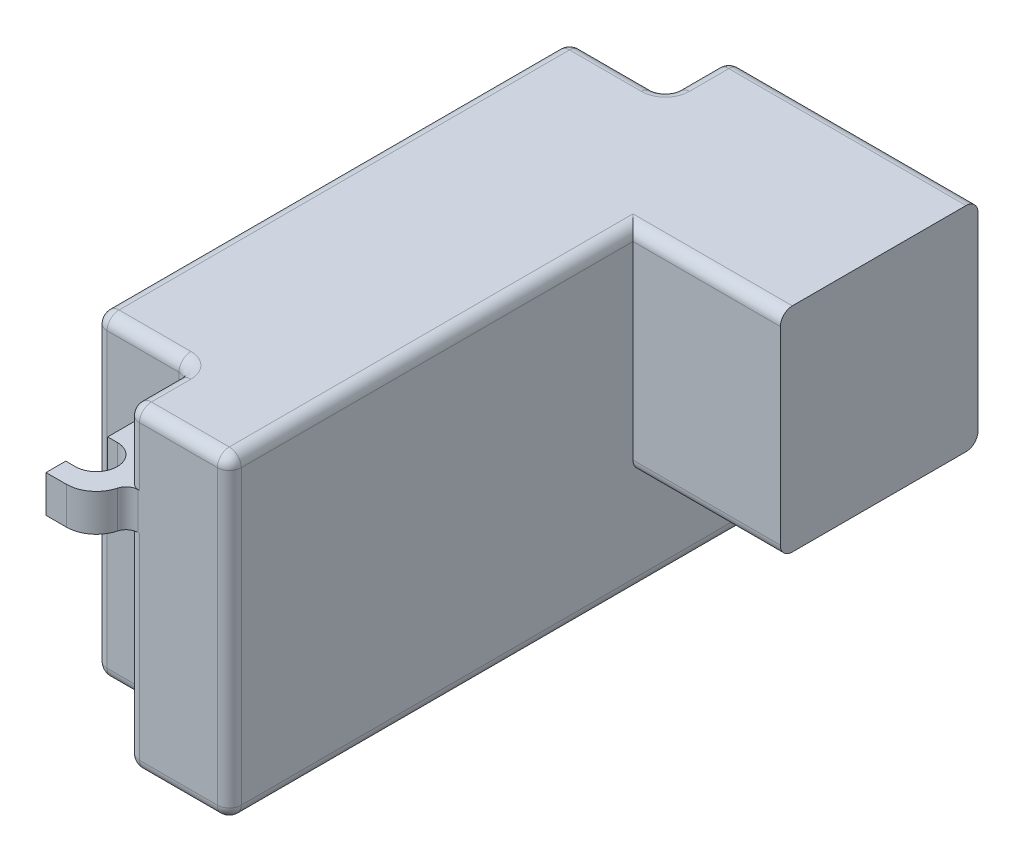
ISO-10303-21;
HEADER;
FILE_DESCRIPTION(('STEP AP214'),'2;1');
FILE_NAME('part.step','',(''),(''),'','','');
FILE_SCHEMA(('AUTOMOTIVE_DESIGN { 1 0 10303 214 1 1 1 1 }'));
ENDSEC;
DATA;
#1=APPLICATION_CONTEXT('core data for automotive mechanical design processes');
#2=APPLICATION_PROTOCOL_DEFINITION('international standard','automotive_design',2000,#1);
#3=PRODUCT_CONTEXT('',#1,'mechanical');
#4=PRODUCT('Part','Part','',(#3));
#5=PRODUCT_RELATED_PRODUCT_CATEGORY('part','',(#4));
#6=PRODUCT_DEFINITION_FORMATION('','',#4);
#7=PRODUCT_DEFINITION_CONTEXT('part definition',#1,'design');
#8=PRODUCT_DEFINITION('design','',#6,#7);
#9=PRODUCT_DEFINITION_SHAPE('','',#8);
#10=(LENGTH_UNIT() NAMED_UNIT(*) SI_UNIT(.MILLI.,.METRE.));
#11=(NAMED_UNIT(*) PLANE_ANGLE_UNIT() SI_UNIT($,.RADIAN.));
#12=(NAMED_UNIT(*) SI_UNIT($,.STERADIAN.) SOLID_ANGLE_UNIT());
#13=UNCERTAINTY_MEASURE_WITH_UNIT(LENGTH_MEASURE(1.E-05),#10,'distance_accuracy_value','');
#14=(GEOMETRIC_REPRESENTATION_CONTEXT(3) GLOBAL_UNCERTAINTY_ASSIGNED_CONTEXT((#13)) GLOBAL_UNIT_ASSIGNED_CONTEXT((#10,
#11,#12)) REPRESENTATION_CONTEXT('',''));
#15=CARTESIAN_POINT('',(0.,0.,0.));
#16=DIRECTION('',(0.,0.,1.));
#17=DIRECTION('',(1.,0.,0.));
#18=AXIS2_PLACEMENT_3D('',#15,#16,#17);
#19=CARTESIAN_POINT('',(-11.5,0.,0.));
#20=DIRECTION('',(-1.,0.,0.));
#21=DIRECTION('',(0.,0.,1.));
#22=AXIS2_PLACEMENT_3D('',#19,#20,#21);
#23=PLANE('',#22);
#24=DIRECTION('',(0.,0.499999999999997,-0.86602540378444));
#25=VECTOR('',#24,1.);
#26=CARTESIAN_POINT('',(-11.5,9.45000000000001,-23.2813466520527));
#27=LINE('',#26,#25);
#28=CARTESIAN_POINT('',(-11.5,9.45000000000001,-23.2813466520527));
#29=VERTEX_POINT('',#28);
#30=CARTESIAN_POINT('',(-11.5,10.5,-25.1));
#31=VERTEX_POINT('',#30);
#32=EDGE_CURVE('E445',#29,#31,#27,.T.);
#33=ORIENTED_EDGE('',*,*,#32,.T.);
#34=DIRECTION('',(0.,-0.500000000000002,-0.866025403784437));
#35=VECTOR('',#34,1.);
#36=CARTESIAN_POINT('',(-11.5,10.5,-25.1));
#37=LINE('',#36,#35);
#38=CARTESIAN_POINT('',(-11.5,9.45,-26.9186533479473));
#39=VERTEX_POINT('',#38);
#40=EDGE_CURVE('E433',#31,#39,#37,.T.);
#41=ORIENTED_EDGE('',*,*,#40,.T.);
#42=DIRECTION('',(0.,-1.,0.));
#43=VECTOR('',#42,1.);
#44=CARTESIAN_POINT('',(-11.5,9.45,-26.9186533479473));
#45=LINE('',#44,#43);
#46=CARTESIAN_POINT('',(-11.5,7.35,-26.9186533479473));
#47=VERTEX_POINT('',#46);
#48=EDGE_CURVE('E444',#39,#47,#45,.T.);
#49=ORIENTED_EDGE('',*,*,#48,.T.);
#50=DIRECTION('',(0.,-0.499999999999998,0.86602540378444));
#51=VECTOR('',#50,1.);
#52=CARTESIAN_POINT('',(-11.5,7.35,-26.9186533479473));
#53=LINE('',#52,#51);
#54=CARTESIAN_POINT('',(-11.5,6.3,-25.1));
#55=VERTEX_POINT('',#54);
#56=EDGE_CURVE('E2110',#47,#55,#53,.T.);
#57=ORIENTED_EDGE('',*,*,#56,.T.);
#58=DIRECTION('',(0.,0.500000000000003,0.866025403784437));
#59=VECTOR('',#58,1.);
#60=CARTESIAN_POINT('',(-11.5,6.3,-25.1));
#61=LINE('',#60,#59);
#62=CARTESIAN_POINT('',(-11.5,7.35000000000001,-23.2813466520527));
#63=VERTEX_POINT('',#62);
#64=EDGE_CURVE('E2123',#55,#63,#61,.T.);
#65=ORIENTED_EDGE('',*,*,#64,.T.);
#66=DIRECTION('',(0.,1.,0.));
#67=VECTOR('',#66,1.);
#68=CARTESIAN_POINT('',(-11.5,7.35000000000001,-23.2813466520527));
#69=LINE('',#68,#67);
#70=EDGE_CURVE('E450',#63,#29,#69,.T.);
#71=ORIENTED_EDGE('',*,*,#70,.T.);
#72=EDGE_LOOP('',(#33,#41,#49,#57,#65,#71));
#73=FACE_BOUND('',#72,.T.);
#74=CARTESIAN_POINT('',(-11.5,8.4,-25.1));
#75=DIRECTION('',(-1.,0.,0.));
#76=DIRECTION('',(0.,0.,1.));
#77=AXIS2_PLACEMENT_3D('',#74,#75,#76);
#78=CIRCLE('',#77,1.2);
#79=CARTESIAN_POINT('',(-11.5,8.4,-23.9));
#80=VERTEX_POINT('',#79);
#81=EDGE_CURVE('E938',#80,#80,#78,.T.);
#82=ORIENTED_EDGE('',*,*,#81,.F.);
#83=EDGE_LOOP('',(#82));
#84=FACE_BOUND('',#83,.T.);
#85=ADVANCED_FACE('F36',(#73,#84),#23,.T.);
#86=CARTESIAN_POINT('',(-0.5,8.4,-25.1));
#87=DIRECTION('',(-1.,0.,0.));
#88=DIRECTION('',(0.,0.,1.));
#89=AXIS2_PLACEMENT_3D('',#86,#87,#88);
#90=PLANE('',#89);
#91=DIRECTION('',(0.,0.499999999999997,-0.86602540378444));
#92=VECTOR('',#91,1.);
#93=CARTESIAN_POINT('',(-0.5,9.45000000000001,-23.2813466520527));
#94=LINE('',#93,#92);
#95=CARTESIAN_POINT('',(-0.5,9.45000000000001,-23.2813466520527));
#96=VERTEX_POINT('',#95);
#97=CARTESIAN_POINT('',(-0.5,10.5,-25.1));
#98=VERTEX_POINT('',#97);
#99=EDGE_CURVE('E457',#96,#98,#94,.T.);
#100=ORIENTED_EDGE('',*,*,#99,.F.);
#101=CARTESIAN_POINT('',(-0.5,8.4,-25.1));
#102=DIRECTION('',(-1.,0.,0.));
#103=DIRECTION('',(0.,0.,1.));
#104=AXIS2_PLACEMENT_3D('',#101,#102,#103);
#105=CIRCLE('',#104,2.1);
#106=EDGE_CURVE('E463',#96,#98,#105,.T.);
#107=ORIENTED_EDGE('',*,*,#106,.T.);
#108=EDGE_LOOP('',(#100,#107));
#109=FACE_BOUND('',#108,.T.);
#110=ADVANCED_FACE('F1117',(#109),#90,.T.);
#111=DIRECTION('',(0.,1.,0.));
#112=VECTOR('',#111,1.);
#113=CARTESIAN_POINT('',(-0.5,7.35000000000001,-23.2813466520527));
#114=LINE('',#113,#112);
#115=CARTESIAN_POINT('',(-0.5,7.35000000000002,-23.2813466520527));
#116=VERTEX_POINT('',#115);
#117=EDGE_CURVE('E454',#116,#96,#114,.T.);
#118=ORIENTED_EDGE('',*,*,#117,.F.);
#119=EDGE_CURVE('E458',#116,#96,#105,.T.);
#120=ORIENTED_EDGE('',*,*,#119,.T.);
#121=EDGE_LOOP('',(#118,#120));
#122=FACE_BOUND('',#121,.T.);
#123=ADVANCED_FACE('F1122',(#122),#90,.T.);
#124=DIRECTION('',(0.,0.500000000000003,0.866025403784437));
#125=VECTOR('',#124,1.);
#126=CARTESIAN_POINT('',(-0.5,6.3,-25.1));
#127=LINE('',#126,#125);
#128=CARTESIAN_POINT('',(-0.5,6.3,-25.1));
#129=VERTEX_POINT('',#128);
#130=EDGE_CURVE('E2084',#129,#116,#127,.T.);
#131=ORIENTED_EDGE('',*,*,#130,.F.);
#132=EDGE_CURVE('E461',#129,#116,#105,.T.);
#133=ORIENTED_EDGE('',*,*,#132,.T.);
#134=EDGE_LOOP('',(#131,#133));
#135=FACE_BOUND('',#134,.T.);
#136=ADVANCED_FACE('F1985',(#135),#90,.T.);
#137=DIRECTION('',(0.,-0.499999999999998,0.86602540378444));
#138=VECTOR('',#137,1.);
#139=CARTESIAN_POINT('',(-0.5,7.35,-26.9186533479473));
#140=LINE('',#139,#138);
#141=CARTESIAN_POINT('',(-0.5,7.34999999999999,-26.9186533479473));
#142=VERTEX_POINT('',#141);
#143=EDGE_CURVE('E2100',#142,#129,#140,.T.);
#144=ORIENTED_EDGE('',*,*,#143,.F.);
#145=EDGE_CURVE('E2093',#142,#129,#105,.T.);
#146=ORIENTED_EDGE('',*,*,#145,.T.);
#147=EDGE_LOOP('',(#144,#146));
#148=FACE_BOUND('',#147,.T.);
#149=ADVANCED_FACE('F1975',(#148),#90,.T.);
#150=DIRECTION('',(0.,-1.,0.));
#151=VECTOR('',#150,1.);
#152=CARTESIAN_POINT('',(-0.5,9.45,-26.9186533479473));
#153=LINE('',#152,#151);
#154=CARTESIAN_POINT('',(-0.5,9.45,-26.9186533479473));
#155=VERTEX_POINT('',#154);
#156=EDGE_CURVE('E2113',#155,#142,#153,.T.);
#157=ORIENTED_EDGE('',*,*,#156,.F.);
#158=EDGE_CURVE('E2134',#155,#142,#105,.T.);
#159=ORIENTED_EDGE('',*,*,#158,.T.);
#160=EDGE_LOOP('',(#157,#159));
#161=FACE_BOUND('',#160,.T.);
#162=ADVANCED_FACE('F1153',(#161),#90,.T.);
#163=CARTESIAN_POINT('',(0.,26.4,-44.9));
#164=DIRECTION('',(1.,0.,0.));
#165=DIRECTION('',(0.,0.,-1.));
#166=AXIS2_PLACEMENT_3D('',#163,#164,#165);
#167=PLANE('',#166);
#168=DIRECTION('',(0.,0.,1.));
#169=VECTOR('',#168,1.);
#170=CARTESIAN_POINT('',(0.,1.,-44.9));
#171=LINE('',#170,#169);
#172=CARTESIAN_POINT('',(0.,1.,-43.9));
#173=VERTEX_POINT('',#172);
#174=CARTESIAN_POINT('',(0.,1.,-6.29999999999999));
#175=VERTEX_POINT('',#174);
#176=EDGE_CURVE('E782',#173,#175,#171,.T.);
#177=ORIENTED_EDGE('',*,*,#176,.T.);
#178=DIRECTION('',(0.,-1.,0.));
#179=VECTOR('',#178,1.);
#180=CARTESIAN_POINT('',(0.,26.4,-6.29999999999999));
#181=LINE('',#180,#179);
#182=CARTESIAN_POINT('',(0.,25.4,-6.29999999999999));
#183=VERTEX_POINT('',#182);
#184=EDGE_CURVE('E784',#175,#183,#181,.F.);
#185=ORIENTED_EDGE('',*,*,#184,.T.);
#186=DIRECTION('',(0.,0.,1.));
#187=VECTOR('',#186,1.);
#188=CARTESIAN_POINT('',(0.,25.4,-44.9));
#189=LINE('',#188,#187);
#190=CARTESIAN_POINT('',(0.,25.4,-43.9));
#191=VERTEX_POINT('',#190);
#192=EDGE_CURVE('E778',#183,#191,#189,.F.);
#193=ORIENTED_EDGE('',*,*,#192,.T.);
#194=DIRECTION('',(0.,-1.,0.));
#195=VECTOR('',#194,1.);
#196=CARTESIAN_POINT('',(0.,26.4,-43.9));
#197=LINE('',#196,#195);
#198=EDGE_CURVE('E780',#191,#173,#197,.T.);
#199=ORIENTED_EDGE('',*,*,#198,.T.);
#200=EDGE_LOOP('',(#177,#185,#193,#199));
#201=FACE_BOUND('',#200,.T.);
#202=CARTESIAN_POINT('',(0.,8.4,-25.1));
#203=DIRECTION('',(1.,0.,0.));
#204=DIRECTION('',(0.,0.,-1.));
#205=AXIS2_PLACEMENT_3D('',#202,#203,#204);
#206=CIRCLE('',#205,2.1);
#207=CARTESIAN_POINT('',(0.,8.4,-27.2));
#208=VERTEX_POINT('',#207);
#209=EDGE_CURVE('E615',#208,#208,#206,.F.);
#210=ORIENTED_EDGE('',*,*,#209,.F.);
#211=EDGE_LOOP('',(#210));
#212=FACE_BOUND('',#211,.T.);
#213=ADVANCED_FACE('F1186',(#201,#212),#167,.F.);
#214=CARTESIAN_POINT('',(3.8,20.5,-44.9));
#215=DIRECTION('',(0.,1.,0.));
#216=DIRECTION('',(0.,0.,1.));
#217=AXIS2_PLACEMENT_3D('',#214,#215,#216);
#218=PLANE('',#217);
#219=DIRECTION('',(1.,0.,0.));
#220=VECTOR('',#219,1.);
#221=CARTESIAN_POINT('',(3.8,20.5,-44.9));
#222=LINE('',#221,#220);
#223=CARTESIAN_POINT('',(3.8,20.5,-44.9));
#224=VERTEX_POINT('',#223);
#225=CARTESIAN_POINT('',(7.,20.5,-44.9));
#226=VERTEX_POINT('',#225);
#227=EDGE_CURVE('E523',#224,#226,#222,.T.);
#228=ORIENTED_EDGE('',*,*,#227,.T.);
#229=CARTESIAN_POINT('',(7.,20.5,-45.9));
#230=DIRECTION('',(0.,1.,0.));
#231=DIRECTION('',(0.,0.,1.));
#232=AXIS2_PLACEMENT_3D('',#229,#230,#231);
#233=CIRCLE('',#232,1.);
#234=CARTESIAN_POINT('',(8.,20.5,-45.9));
#235=VERTEX_POINT('',#234);
#236=EDGE_CURVE('E701',#226,#235,#233,.T.);
#237=ORIENTED_EDGE('',*,*,#236,.T.);
#238=DIRECTION('',(0.,0.,1.));
#239=VECTOR('',#238,1.);
#240=CARTESIAN_POINT('',(8.,20.5,-44.9));
#241=LINE('',#240,#239);
#242=CARTESIAN_POINT('',(8.,20.5,-49.2));
#243=VERTEX_POINT('',#242);
#244=EDGE_CURVE('E489',#243,#235,#241,.T.);
#245=ORIENTED_EDGE('',*,*,#244,.F.);
#246=CARTESIAN_POINT('',(9.,20.5,-49.2));
#247=DIRECTION('',(0.,1.,0.));
#248=DIRECTION('',(0.,0.,1.));
#249=AXIS2_PLACEMENT_3D('',#246,#247,#248);
#250=CIRCLE('',#249,1.);
#251=CARTESIAN_POINT('',(9.,20.5,-50.2));
#252=VERTEX_POINT('',#251);
#253=EDGE_CURVE('E794',#243,#252,#250,.F.);
#254=ORIENTED_EDGE('',*,*,#253,.T.);
#255=DIRECTION('',(1.,0.,0.));
#256=VECTOR('',#255,1.);
#257=CARTESIAN_POINT('',(3.8,20.5,-50.2));
#258=LINE('',#257,#256);
#259=CARTESIAN_POINT('',(8.88230690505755,20.5,-50.2));
#260=VERTEX_POINT('',#259);
#261=EDGE_CURVE('E764',#260,#252,#258,.T.);
#262=ORIENTED_EDGE('',*,*,#261,.F.);
#263=CARTESIAN_POINT('',(8.88230690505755,20.5,-51.2));
#264=DIRECTION('',(0.,1.,0.));
#265=DIRECTION('',(0.,0.,1.));
#266=AXIS2_PLACEMENT_3D('',#263,#264,#265);
#267=CIRCLE('',#266,1.);
#268=CARTESIAN_POINT('',(7.91593350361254,20.5,-50.9428571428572));
#269=VERTEX_POINT('',#268);
#270=EDGE_CURVE('E44',#260,#269,#267,.F.);
#271=ORIENTED_EDGE('',*,*,#270,.T.);
#272=CARTESIAN_POINT('',(5.5,20.5,-50.3));
#273=DIRECTION('',(0.,1.,0.));
#274=DIRECTION('',(0.,0.,1.));
#275=AXIS2_PLACEMENT_3D('',#272,#273,#274);
#276=CIRCLE('',#275,2.5);
#277=CARTESIAN_POINT('',(5.5,20.5,-52.8));
#278=VERTEX_POINT('',#277);
#279=EDGE_CURVE('E609',#269,#278,#276,.T.);
#280=ORIENTED_EDGE('',*,*,#279,.T.);
#281=DIRECTION('',(1.,0.,0.));
#282=VECTOR('',#281,1.);
#283=CARTESIAN_POINT('',(3.8,20.5,-52.8));
#284=LINE('',#283,#282);
#285=CARTESIAN_POINT('',(3.8,20.5,-52.8));
#286=VERTEX_POINT('',#285);
#287=EDGE_CURVE('E520',#286,#278,#284,.T.);
#288=ORIENTED_EDGE('',*,*,#287,.F.);
#289=DIRECTION('',(0.,0.,1.));
#290=VECTOR('',#289,1.);
#291=CARTESIAN_POINT('',(3.8,20.5,-44.9));
#292=LINE('',#291,#290);
#293=CARTESIAN_POINT('',(3.8,20.5,-51.15));
#294=VERTEX_POINT('',#293);
#295=EDGE_CURVE('E500',#286,#294,#292,.T.);
#296=ORIENTED_EDGE('',*,*,#295,.T.);
#297=DIRECTION('',(1.,0.,0.));
#298=VECTOR('',#297,1.);
#299=CARTESIAN_POINT('',(3.8,20.5,-51.15));
#300=LINE('',#299,#298);
#301=CARTESIAN_POINT('',(4.6,20.5,-51.15));
#302=VERTEX_POINT('',#301);
#303=EDGE_CURVE('E481',#294,#302,#300,.T.);
#304=ORIENTED_EDGE('',*,*,#303,.T.);
#305=CARTESIAN_POINT('',(4.6,20.5,-49.4));
#306=DIRECTION('',(0.,-1.,0.));
#307=DIRECTION('',(0.,0.,-1.));
#308=AXIS2_PLACEMENT_3D('',#305,#306,#307);
#309=CIRCLE('',#308,1.75);
#310=CARTESIAN_POINT('',(4.6,20.5,-47.65));
#311=VERTEX_POINT('',#310);
#312=EDGE_CURVE('E469',#302,#311,#309,.T.);
#313=ORIENTED_EDGE('',*,*,#312,.T.);
#314=DIRECTION('',(-1.,0.,0.));
#315=VECTOR('',#314,1.);
#316=CARTESIAN_POINT('',(4.6,20.5,-47.65));
#317=LINE('',#316,#315);
#318=CARTESIAN_POINT('',(3.8,20.5,-47.65));
#319=VERTEX_POINT('',#318);
#320=EDGE_CURVE('E474',#311,#319,#317,.T.);
#321=ORIENTED_EDGE('',*,*,#320,.T.);
#322=EDGE_CURVE('E498',#319,#224,#292,.T.);
#323=ORIENTED_EDGE('',*,*,#322,.T.);
#324=EDGE_LOOP('',(#228,#237,#245,#254,#262,#271,#280,#288,#296,#304,#313,#321,#323));
#325=FACE_BOUND('',#324,.T.);
#326=ADVANCED_FACE('F1179',(#325),#218,.T.);
#327=CARTESIAN_POINT('',(3.8,17.4,-44.9));
#328=DIRECTION('',(0.,-1.,0.));
#329=DIRECTION('',(0.,0.,-1.));
#330=AXIS2_PLACEMENT_3D('',#327,#328,#329);
#331=PLANE('',#330);
#332=DIRECTION('',(0.,0.,-1.));
#333=VECTOR('',#332,1.);
#334=CARTESIAN_POINT('',(8.,17.4,-44.9));
#335=LINE('',#334,#333);
#336=CARTESIAN_POINT('',(8.,17.4,-45.9));
#337=VERTEX_POINT('',#336);
#338=CARTESIAN_POINT('',(8.,17.4,-49.2));
#339=VERTEX_POINT('',#338);
#340=EDGE_CURVE('E499',#337,#339,#335,.T.);
#341=ORIENTED_EDGE('',*,*,#340,.F.);
#342=CARTESIAN_POINT('',(7.,17.4,-45.9));
#343=DIRECTION('',(0.,-1.,0.));
#344=DIRECTION('',(0.,0.,-1.));
#345=AXIS2_PLACEMENT_3D('',#342,#343,#344);
#346=CIRCLE('',#345,1.);
#347=CARTESIAN_POINT('',(7.,17.4,-44.9));
#348=VERTEX_POINT('',#347);
#349=EDGE_CURVE('E715',#337,#348,#346,.T.);
#350=ORIENTED_EDGE('',*,*,#349,.T.);
#351=DIRECTION('',(1.,0.,0.));
#352=VECTOR('',#351,1.);
#353=CARTESIAN_POINT('',(3.8,17.4,-44.9));
#354=LINE('',#353,#352);
#355=CARTESIAN_POINT('',(3.8,17.4,-44.9));
#356=VERTEX_POINT('',#355);
#357=EDGE_CURVE('E510',#356,#348,#354,.T.);
#358=ORIENTED_EDGE('',*,*,#357,.F.);
#359=DIRECTION('',(0.,0.,-1.));
#360=VECTOR('',#359,1.);
#361=CARTESIAN_POINT('',(3.8,17.4,-44.9));
#362=LINE('',#361,#360);
#363=CARTESIAN_POINT('',(3.8,17.4,-47.65));
#364=VERTEX_POINT('',#363);
#365=EDGE_CURVE('E507',#356,#364,#362,.T.);
#366=ORIENTED_EDGE('',*,*,#365,.T.);
#367=DIRECTION('',(-1.,0.,0.));
#368=VECTOR('',#367,1.);
#369=CARTESIAN_POINT('',(4.6,17.4,-47.65));
#370=LINE('',#369,#368);
#371=CARTESIAN_POINT('',(4.6,17.4,-47.65));
#372=VERTEX_POINT('',#371);
#373=EDGE_CURVE('E476',#372,#364,#370,.T.);
#374=ORIENTED_EDGE('',*,*,#373,.F.);
#375=CARTESIAN_POINT('',(4.6,17.4,-49.4));
#376=DIRECTION('',(0.,-1.,0.));
#377=DIRECTION('',(0.,0.,-1.));
#378=AXIS2_PLACEMENT_3D('',#375,#376,#377);
#379=CIRCLE('',#378,1.75);
#380=CARTESIAN_POINT('',(4.6,17.4,-51.15));
#381=VERTEX_POINT('',#380);
#382=EDGE_CURVE('E471',#381,#372,#379,.T.);
#383=ORIENTED_EDGE('',*,*,#382,.F.);
#384=DIRECTION('',(1.,0.,0.));
#385=VECTOR('',#384,1.);
#386=CARTESIAN_POINT('',(3.8,17.4,-51.15));
#387=LINE('',#386,#385);
#388=CARTESIAN_POINT('',(3.8,17.4,-51.15));
#389=VERTEX_POINT('',#388);
#390=EDGE_CURVE('E473',#389,#381,#387,.T.);
#391=ORIENTED_EDGE('',*,*,#390,.F.);
#392=CARTESIAN_POINT('',(3.8,17.4,-52.8));
#393=VERTEX_POINT('',#392);
#394=EDGE_CURVE('E506',#389,#393,#362,.T.);
#395=ORIENTED_EDGE('',*,*,#394,.T.);
#396=DIRECTION('',(1.,0.,0.));
#397=VECTOR('',#396,1.);
#398=CARTESIAN_POINT('',(3.8,17.4,-52.8));
#399=LINE('',#398,#397);
#400=CARTESIAN_POINT('',(5.5,17.4,-52.8));
#401=VERTEX_POINT('',#400);
#402=EDGE_CURVE('E517',#393,#401,#399,.T.);
#403=ORIENTED_EDGE('',*,*,#402,.T.);
#404=CARTESIAN_POINT('',(5.5,17.4,-50.3));
#405=DIRECTION('',(0.,-1.,0.));
#406=DIRECTION('',(0.,0.,-1.));
#407=AXIS2_PLACEMENT_3D('',#404,#405,#406);
#408=CIRCLE('',#407,2.5);
#409=CARTESIAN_POINT('',(7.91593350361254,17.4,-50.9428571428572));
#410=VERTEX_POINT('',#409);
#411=EDGE_CURVE('E613',#401,#410,#408,.T.);
#412=ORIENTED_EDGE('',*,*,#411,.T.);
#413=CARTESIAN_POINT('',(8.88230690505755,17.4,-51.2));
#414=DIRECTION('',(0.,-1.,0.));
#415=DIRECTION('',(0.,0.,-1.));
#416=AXIS2_PLACEMENT_3D('',#413,#414,#415);
#417=CIRCLE('',#416,1.);
#418=CARTESIAN_POINT('',(8.88230690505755,17.4,-50.2));
#419=VERTEX_POINT('',#418);
#420=EDGE_CURVE('E11',#410,#419,#417,.F.);
#421=ORIENTED_EDGE('',*,*,#420,.T.);
#422=DIRECTION('',(-1.,0.,0.));
#423=VECTOR('',#422,1.);
#424=CARTESIAN_POINT('',(3.8,17.4,-50.2));
#425=LINE('',#424,#423);
#426=CARTESIAN_POINT('',(9.,17.4,-50.2));
#427=VERTEX_POINT('',#426);
#428=EDGE_CURVE('E766',#427,#419,#425,.T.);
#429=ORIENTED_EDGE('',*,*,#428,.F.);
#430=CARTESIAN_POINT('',(9.,17.4,-49.2));
#431=DIRECTION('',(0.,-1.,0.));
#432=DIRECTION('',(0.,0.,-1.));
#433=AXIS2_PLACEMENT_3D('',#430,#431,#432);
#434=CIRCLE('',#433,1.);
#435=EDGE_CURVE('E797',#427,#339,#434,.F.);
#436=ORIENTED_EDGE('',*,*,#435,.T.);
#437=EDGE_LOOP('',(#341,#350,#358,#366,#374,#383,#391,#395,#403,#412,#421,#429,#436));
#438=FACE_BOUND('',#437,.T.);
#439=ADVANCED_FACE('F1175',(#438),#331,.T.);
#440=CARTESIAN_POINT('',(3.8,0.,-50.2));
#441=DIRECTION('',(1.,0.,0.));
#442=DIRECTION('',(0.,0.,1.));
#443=AXIS2_PLACEMENT_3D('',#440,#441,#442);
#444=PLANE('',#443);
#445=DIRECTION('',(0.,1.,0.));
#446=VECTOR('',#445,1.);
#447=CARTESIAN_POINT('',(3.8,17.4,-47.65));
#448=LINE('',#447,#446);
#449=EDGE_CURVE('E490',#364,#319,#448,.T.);
#450=ORIENTED_EDGE('',*,*,#449,.F.);
#451=ORIENTED_EDGE('',*,*,#365,.F.);
#452=DIRECTION('',(0.,-1.,0.));
#453=VECTOR('',#452,1.);
#454=CARTESIAN_POINT('',(3.8,17.4,-44.9));
#455=LINE('',#454,#453);
#456=EDGE_CURVE('E496',#224,#356,#455,.T.);
#457=ORIENTED_EDGE('',*,*,#456,.F.);
#458=ORIENTED_EDGE('',*,*,#322,.F.);
#459=EDGE_LOOP('',(#450,#451,#457,#458));
#460=FACE_BOUND('',#459,.T.);
#461=ADVANCED_FACE('F1171',(#460),#444,.F.);
#462=DIRECTION('',(0.,1.,0.));
#463=VECTOR('',#462,1.);
#464=CARTESIAN_POINT('',(3.8,17.4,-51.15));
#465=LINE('',#464,#463);
#466=EDGE_CURVE('E492',#389,#294,#465,.T.);
#467=ORIENTED_EDGE('',*,*,#466,.T.);
#468=ORIENTED_EDGE('',*,*,#295,.F.);
#469=DIRECTION('',(0.,1.,0.));
#470=VECTOR('',#469,1.);
#471=CARTESIAN_POINT('',(3.8,17.4,-52.8));
#472=LINE('',#471,#470);
#473=EDGE_CURVE('E503',#393,#286,#472,.T.);
#474=ORIENTED_EDGE('',*,*,#473,.F.);
#475=ORIENTED_EDGE('',*,*,#394,.F.);
#476=EDGE_LOOP('',(#467,#468,#474,#475));
#477=FACE_BOUND('',#476,.T.);
#478=ADVANCED_FACE('F1174',(#477),#444,.F.);
#479=CARTESIAN_POINT('',(8.,26.4,-44.9));
#480=DIRECTION('',(1.,0.,0.));
#481=DIRECTION('',(0.,0.,-1.));
#482=AXIS2_PLACEMENT_3D('',#479,#480,#481);
#483=PLANE('',#482);
#484=ORIENTED_EDGE('',*,*,#244,.T.);
#485=DIRECTION('',(0.,-1.,0.));
#486=VECTOR('',#485,1.);
#487=CARTESIAN_POINT('',(8.,26.4,-45.9));
#488=LINE('',#487,#486);
#489=CARTESIAN_POINT('',(8.,25.4,-45.9));
#490=VERTEX_POINT('',#489);
#491=EDGE_CURVE('E707',#235,#490,#488,.F.);
#492=ORIENTED_EDGE('',*,*,#491,.T.);
#493=DIRECTION('',(0.,0.,1.));
#494=VECTOR('',#493,1.);
#495=CARTESIAN_POINT('',(8.,25.4,-50.2));
#496=LINE('',#495,#494);
#497=CARTESIAN_POINT('',(8.,25.4,-49.2));
#498=VERTEX_POINT('',#497);
#499=EDGE_CURVE('E703',#490,#498,#496,.F.);
#500=ORIENTED_EDGE('',*,*,#499,.T.);
#501=DIRECTION('',(0.,-1.,0.));
#502=VECTOR('',#501,1.);
#503=CARTESIAN_POINT('',(8.,26.4,-49.2));
#504=LINE('',#503,#502);
#505=EDGE_CURVE('E705',#498,#243,#504,.T.);
#506=ORIENTED_EDGE('',*,*,#505,.T.);
#507=EDGE_LOOP('',(#484,#492,#500,#506));
#508=FACE_BOUND('',#507,.T.);
#509=ADVANCED_FACE('F1222',(#508),#483,.F.);
#510=CARTESIAN_POINT('',(3.8,0.,0.));
#511=DIRECTION('',(1.,0.,0.));
#512=DIRECTION('',(0.,0.,-1.));
#513=AXIS2_PLACEMENT_3D('',#510,#511,#512);
#514=PLANE('',#513);
#515=DIRECTION('',(0.,0.,-1.));
#516=VECTOR('',#515,1.);
#517=CARTESIAN_POINT('',(3.8,20.5,-5.29999999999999));
#518=LINE('',#517,#516);
#519=CARTESIAN_POINT('',(3.8,20.5,2.60000000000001));
#520=VERTEX_POINT('',#519);
#521=CARTESIAN_POINT('',(3.8,20.5,0.950000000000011));
#522=VERTEX_POINT('',#521);
#523=EDGE_CURVE('E564',#520,#522,#518,.T.);
#524=ORIENTED_EDGE('',*,*,#523,.T.);
#525=DIRECTION('',(0.,1.,0.));
#526=VECTOR('',#525,1.);
#527=CARTESIAN_POINT('',(3.8,17.4,0.950000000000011));
#528=LINE('',#527,#526);
#529=CARTESIAN_POINT('',(3.8,17.4,0.950000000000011));
#530=VERTEX_POINT('',#529);
#531=EDGE_CURVE('E547',#530,#522,#528,.T.);
#532=ORIENTED_EDGE('',*,*,#531,.F.);
#533=DIRECTION('',(0.,0.,1.));
#534=VECTOR('',#533,1.);
#535=CARTESIAN_POINT('',(3.8,17.4,-5.29999999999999));
#536=LINE('',#535,#534);
#537=CARTESIAN_POINT('',(3.8,17.4,2.60000000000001));
#538=VERTEX_POINT('',#537);
#539=EDGE_CURVE('E556',#530,#538,#536,.T.);
#540=ORIENTED_EDGE('',*,*,#539,.T.);
#541=DIRECTION('',(0.,1.,0.));
#542=VECTOR('',#541,1.);
#543=CARTESIAN_POINT('',(3.8,17.4,2.60000000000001));
#544=LINE('',#543,#542);
#545=EDGE_CURVE('E561',#538,#520,#544,.T.);
#546=ORIENTED_EDGE('',*,*,#545,.T.);
#547=EDGE_LOOP('',(#524,#532,#540,#546));
#548=FACE_BOUND('',#547,.T.);
#549=ADVANCED_FACE('F978',(#548),#514,.F.);
#550=CARTESIAN_POINT('',(0.,26.4,-5.29999999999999));
#551=DIRECTION('',(0.,0.,-1.));
#552=DIRECTION('',(-1.,0.,0.));
#553=AXIS2_PLACEMENT_3D('',#550,#551,#552);
#554=PLANE('',#553);
#555=DIRECTION('',(1.,0.,0.));
#556=VECTOR('',#555,1.);
#557=CARTESIAN_POINT('',(3.8,20.5,-5.29999999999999));
#558=LINE('',#557,#556);
#559=CARTESIAN_POINT('',(3.8,20.5,-5.29999999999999));
#560=VERTEX_POINT('',#559);
#561=CARTESIAN_POINT('',(7.,20.5,-5.29999999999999));
#562=VERTEX_POINT('',#561);
#563=EDGE_CURVE('E567',#560,#562,#558,.T.);
#564=ORIENTED_EDGE('',*,*,#563,.T.);
#565=DIRECTION('',(0.,-1.,0.));
#566=VECTOR('',#565,1.);
#567=CARTESIAN_POINT('',(7.,26.4,-5.29999999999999));
#568=LINE('',#567,#566);
#569=CARTESIAN_POINT('',(7.,25.4,-5.29999999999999));
#570=VERTEX_POINT('',#569);
#571=EDGE_CURVE('E734',#562,#570,#568,.F.);
#572=ORIENTED_EDGE('',*,*,#571,.T.);
#573=DIRECTION('',(1.,0.,0.));
#574=VECTOR('',#573,1.);
#575=CARTESIAN_POINT('',(0.,25.4,-5.29999999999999));
#576=LINE('',#575,#574);
#577=CARTESIAN_POINT('',(1.,25.4,-5.29999999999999));
#578=VERTEX_POINT('',#577);
#579=EDGE_CURVE('E726',#570,#578,#576,.F.);
#580=ORIENTED_EDGE('',*,*,#579,.T.);
#581=DIRECTION('',(0.,-1.,0.));
#582=VECTOR('',#581,1.);
#583=CARTESIAN_POINT('',(1.,26.4,-5.29999999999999));
#584=LINE('',#583,#582);
#585=CARTESIAN_POINT('',(1.,1.,-5.29999999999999));
#586=VERTEX_POINT('',#585);
#587=EDGE_CURVE('E728',#578,#586,#584,.T.);
#588=ORIENTED_EDGE('',*,*,#587,.T.);
#589=DIRECTION('',(1.,0.,0.));
#590=VECTOR('',#589,1.);
#591=CARTESIAN_POINT('',(0.,1.,-5.29999999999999));
#592=LINE('',#591,#590);
#593=CARTESIAN_POINT('',(7.,1.,-5.29999999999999));
#594=VERTEX_POINT('',#593);
#595=EDGE_CURVE('E730',#586,#594,#592,.T.);
#596=ORIENTED_EDGE('',*,*,#595,.T.);
#597=DIRECTION('',(0.,-1.,0.));
#598=VECTOR('',#597,1.);
#599=CARTESIAN_POINT('',(7.,17.4,-5.29999999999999));
#600=LINE('',#599,#598);
#601=CARTESIAN_POINT('',(7.,17.4,-5.29999999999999));
#602=VERTEX_POINT('',#601);
#603=EDGE_CURVE('E732',#594,#602,#600,.F.);
#604=ORIENTED_EDGE('',*,*,#603,.T.);
#605=DIRECTION('',(1.,0.,0.));
#606=VECTOR('',#605,1.);
#607=CARTESIAN_POINT('',(3.8,17.4,-5.29999999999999));
#608=LINE('',#607,#606);
#609=CARTESIAN_POINT('',(3.8,17.4,-5.29999999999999));
#610=VERTEX_POINT('',#609);
#611=EDGE_CURVE('E580',#610,#602,#608,.T.);
#612=ORIENTED_EDGE('',*,*,#611,.F.);
#613=DIRECTION('',(0.,-1.,0.));
#614=VECTOR('',#613,1.);
#615=CARTESIAN_POINT('',(3.8,17.4,-5.29999999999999));
#616=LINE('',#615,#614);
#617=EDGE_CURVE('E553',#560,#610,#616,.T.);
#618=ORIENTED_EDGE('',*,*,#617,.F.);
#619=EDGE_LOOP('',(#564,#572,#580,#588,#596,#604,#612,#618));
#620=FACE_BOUND('',#619,.T.);
#621=ADVANCED_FACE('F996',(#620),#554,.F.);
#622=CARTESIAN_POINT('',(8.,26.4,-5.29999999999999));
#623=DIRECTION('',(1.,0.,0.));
#624=DIRECTION('',(0.,0.,-1.));
#625=AXIS2_PLACEMENT_3D('',#622,#623,#624);
#626=PLANE('',#625);
#627=DIRECTION('',(0.,0.,1.));
#628=VECTOR('',#627,1.);
#629=CARTESIAN_POINT('',(8.,17.4,-5.29999999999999));
#630=LINE('',#629,#628);
#631=CARTESIAN_POINT('',(8.,17.4,-4.29999999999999));
#632=VERTEX_POINT('',#631);
#633=CARTESIAN_POINT('',(8.,17.4,-0.999999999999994));
#634=VERTEX_POINT('',#633);
#635=EDGE_CURVE('E546',#632,#634,#630,.T.);
#636=ORIENTED_EDGE('',*,*,#635,.F.);
#637=DIRECTION('',(0.,-1.,0.));
#638=VECTOR('',#637,1.);
#639=CARTESIAN_POINT('',(8.,0.,-4.29999999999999));
#640=LINE('',#639,#638);
#641=CARTESIAN_POINT('',(8.,1.,-4.29999999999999));
#642=VERTEX_POINT('',#641);
#643=EDGE_CURVE('E740',#632,#642,#640,.T.);
#644=ORIENTED_EDGE('',*,*,#643,.T.);
#645=DIRECTION('',(0.,0.,1.));
#646=VECTOR('',#645,1.);
#647=CARTESIAN_POINT('',(8.,1.,-5.29999999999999));
#648=LINE('',#647,#646);
#649=CARTESIAN_POINT('',(8.,1.,-0.999999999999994));
#650=VERTEX_POINT('',#649);
#651=EDGE_CURVE('E736',#642,#650,#648,.T.);
#652=ORIENTED_EDGE('',*,*,#651,.T.);
#653=DIRECTION('',(0.,-1.,0.));
#654=VECTOR('',#653,1.);
#655=CARTESIAN_POINT('',(8.,26.4,-0.999999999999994));
#656=LINE('',#655,#654);
#657=EDGE_CURVE('E738',#650,#634,#656,.F.);
#658=ORIENTED_EDGE('',*,*,#657,.T.);
#659=EDGE_LOOP('',(#636,#644,#652,#658));
#660=FACE_BOUND('',#659,.T.);
#661=ADVANCED_FACE('F1007',(#660),#626,.F.);
#662=DIRECTION('',(0.,0.,1.));
#663=VECTOR('',#662,1.);
#664=CARTESIAN_POINT('',(8.,25.4,-5.29999999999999));
#665=LINE('',#664,#663);
#666=CARTESIAN_POINT('',(8.,25.4,-0.999999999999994));
#667=VERTEX_POINT('',#666);
#668=CARTESIAN_POINT('',(8.,25.4,-4.29999999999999));
#669=VERTEX_POINT('',#668);
#670=EDGE_CURVE('E717',#667,#669,#665,.F.);
#671=ORIENTED_EDGE('',*,*,#670,.T.);
#672=DIRECTION('',(0.,-1.,0.));
#673=VECTOR('',#672,1.);
#674=CARTESIAN_POINT('',(8.,20.5,-4.29999999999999));
#675=LINE('',#674,#673);
#676=CARTESIAN_POINT('',(8.,20.5,-4.29999999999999));
#677=VERTEX_POINT('',#676);
#678=EDGE_CURVE('E721',#669,#677,#675,.T.);
#679=ORIENTED_EDGE('',*,*,#678,.T.);
#680=DIRECTION('',(0.,0.,-1.));
#681=VECTOR('',#680,1.);
#682=CARTESIAN_POINT('',(8.,20.5,-5.29999999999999));
#683=LINE('',#682,#681);
#684=CARTESIAN_POINT('',(8.,20.5,-0.999999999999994));
#685=VERTEX_POINT('',#684);
#686=EDGE_CURVE('E557',#685,#677,#683,.T.);
#687=ORIENTED_EDGE('',*,*,#686,.F.);
#688=DIRECTION('',(0.,-1.,0.));
#689=VECTOR('',#688,1.);
#690=CARTESIAN_POINT('',(8.,26.4,-0.999999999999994));
#691=LINE('',#690,#689);
#692=EDGE_CURVE('E719',#685,#667,#691,.F.);
#693=ORIENTED_EDGE('',*,*,#692,.T.);
#694=EDGE_LOOP('',(#671,#679,#687,#693));
#695=FACE_BOUND('',#694,.T.);
#696=ADVANCED_FACE('F1069',(#695),#626,.F.);
#697=CARTESIAN_POINT('',(8.,26.4,0.));
#698=DIRECTION('',(0.,0.,-1.));
#699=DIRECTION('',(-1.,0.,0.));
#700=AXIS2_PLACEMENT_3D('',#697,#698,#699);
#701=PLANE('',#700);
#702=DIRECTION('',(-1.,0.,0.));
#703=VECTOR('',#702,1.);
#704=CARTESIAN_POINT('',(8.,20.5,0.));
#705=LINE('',#704,#703);
#706=CARTESIAN_POINT('',(9.,20.5,0.));
#707=VERTEX_POINT('',#706);
#708=CARTESIAN_POINT('',(8.88230690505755,20.5,0.));
#709=VERTEX_POINT('',#708);
#710=EDGE_CURVE('E755',#707,#709,#705,.T.);
#711=ORIENTED_EDGE('',*,*,#710,.T.);
#712=DIRECTION('',(0.,-1.,0.));
#713=VECTOR('',#712,1.);
#714=CARTESIAN_POINT('',(8.88230690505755,26.4,0.));
#715=LINE('',#714,#713);
#716=CARTESIAN_POINT('',(8.88230690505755,17.4,0.));
#717=VERTEX_POINT('',#716);
#718=EDGE_CURVE('E799',#709,#717,#715,.T.);
#719=ORIENTED_EDGE('',*,*,#718,.T.);
#720=DIRECTION('',(1.,0.,0.));
#721=VECTOR('',#720,1.);
#722=CARTESIAN_POINT('',(8.,17.4,0.));
#723=LINE('',#722,#721);
#724=CARTESIAN_POINT('',(9.,17.4,0.));
#725=VERTEX_POINT('',#724);
#726=EDGE_CURVE('E758',#717,#725,#723,.T.);
#727=ORIENTED_EDGE('',*,*,#726,.T.);
#728=DIRECTION('',(0.,-1.,0.));
#729=VECTOR('',#728,1.);
#730=CARTESIAN_POINT('',(9.,26.4,0.));
#731=LINE('',#730,#729);
#732=CARTESIAN_POINT('',(9.,1.,0.));
#733=VERTEX_POINT('',#732);
#734=EDGE_CURVE('E753',#725,#733,#731,.T.);
#735=ORIENTED_EDGE('',*,*,#734,.T.);
#736=DIRECTION('',(1.,0.,0.));
#737=VECTOR('',#736,1.);
#738=CARTESIAN_POINT('',(8.,1.,0.));
#739=LINE('',#738,#737);
#740=CARTESIAN_POINT('',(15.5,1.,0.));
#741=VERTEX_POINT('',#740);
#742=EDGE_CURVE('E751',#733,#741,#739,.T.);
#743=ORIENTED_EDGE('',*,*,#742,.T.);
#744=DIRECTION('',(0.,-1.,0.));
#745=VECTOR('',#744,1.);
#746=CARTESIAN_POINT('',(15.5,26.4,0.));
#747=LINE('',#746,#745);
#748=CARTESIAN_POINT('',(15.5,25.4,0.));
#749=VERTEX_POINT('',#748);
#750=EDGE_CURVE('E749',#741,#749,#747,.F.);
#751=ORIENTED_EDGE('',*,*,#750,.T.);
#752=DIRECTION('',(1.,0.,0.));
#753=VECTOR('',#752,1.);
#754=CARTESIAN_POINT('',(8.,25.4,0.));
#755=LINE('',#754,#753);
#756=CARTESIAN_POINT('',(9.,25.4,0.));
#757=VERTEX_POINT('',#756);
#758=EDGE_CURVE('E744',#749,#757,#755,.F.);
#759=ORIENTED_EDGE('',*,*,#758,.T.);
#760=DIRECTION('',(0.,-1.,0.));
#761=VECTOR('',#760,1.);
#762=CARTESIAN_POINT('',(9.,26.4,0.));
#763=LINE('',#762,#761);
#764=EDGE_CURVE('E746',#757,#707,#763,.T.);
#765=ORIENTED_EDGE('',*,*,#764,.T.);
#766=EDGE_LOOP('',(#711,#719,#727,#735,#743,#751,#759,#765));
#767=FACE_BOUND('',#766,.T.);
#768=ADVANCED_FACE('F957',(#767),#701,.F.);
#769=CARTESIAN_POINT('',(16.5,26.4,0.));
#770=DIRECTION('',(-1.,0.,0.));
#771=DIRECTION('',(0.,0.,1.));
#772=AXIS2_PLACEMENT_3D('',#769,#770,#771);
#773=PLANE('',#772);
#774=DIRECTION('',(0.,-1.,0.));
#775=VECTOR('',#774,1.);
#776=CARTESIAN_POINT('',(16.5,26.4,-33.7));
#777=LINE('',#776,#775);
#778=CARTESIAN_POINT('',(16.5,25.4,-33.7));
#779=VERTEX_POINT('',#778);
#780=CARTESIAN_POINT('',(16.5,9.6,-33.7));
#781=VERTEX_POINT('',#780);
#782=EDGE_CURVE('E598',#779,#781,#777,.T.);
#783=ORIENTED_EDGE('',*,*,#782,.F.);
#784=DIRECTION('',(0.,0.,-1.));
#785=VECTOR('',#784,1.);
#786=CARTESIAN_POINT('',(16.5,25.4,0.));
#787=LINE('',#786,#785);
#788=CARTESIAN_POINT('',(16.5,25.4,-0.999999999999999));
#789=VERTEX_POINT('',#788);
#790=EDGE_CURVE('E625',#779,#789,#787,.F.);
#791=ORIENTED_EDGE('',*,*,#790,.T.);
#792=DIRECTION('',(0.,-1.,0.));
#793=VECTOR('',#792,1.);
#794=CARTESIAN_POINT('',(16.5,26.4,-0.999999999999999));
#795=LINE('',#794,#793);
#796=CARTESIAN_POINT('',(16.5,1.,-0.999999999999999));
#797=VERTEX_POINT('',#796);
#798=EDGE_CURVE('E623',#789,#797,#795,.T.);
#799=ORIENTED_EDGE('',*,*,#798,.T.);
#800=DIRECTION('',(0.,0.,-1.));
#801=VECTOR('',#800,1.);
#802=CARTESIAN_POINT('',(16.5,1.,0.));
#803=LINE('',#802,#801);
#804=CARTESIAN_POINT('',(16.5,1.,-49.2));
#805=VERTEX_POINT('',#804);
#806=EDGE_CURVE('E620',#797,#805,#803,.T.);
#807=ORIENTED_EDGE('',*,*,#806,.T.);
#808=DIRECTION('',(0.,1.,0.));
#809=VECTOR('',#808,1.);
#810=CARTESIAN_POINT('',(16.5,26.4,-49.2));
#811=LINE('',#810,#809);
#812=CARTESIAN_POINT('',(16.5,8.6,-49.2));
#813=VERTEX_POINT('',#812);
#814=EDGE_CURVE('E618',#805,#813,#811,.T.);
#815=ORIENTED_EDGE('',*,*,#814,.T.);
#816=DIRECTION('',(0.,0.,-1.));
#817=VECTOR('',#816,1.);
#818=CARTESIAN_POINT('',(16.5,8.6,-33.7));
#819=LINE('',#818,#817);
#820=CARTESIAN_POINT('',(16.5,8.6,-34.7));
#821=VERTEX_POINT('',#820);
#822=EDGE_CURVE('E583',#821,#813,#819,.T.);
#823=ORIENTED_EDGE('',*,*,#822,.F.);
#824=CARTESIAN_POINT('',(16.5,9.6,-34.7));
#825=DIRECTION('',(-1.,0.,0.));
#826=DIRECTION('',(0.,0.,1.));
#827=AXIS2_PLACEMENT_3D('',#824,#825,#826);
#828=CIRCLE('',#827,1.);
#829=EDGE_CURVE('E787',#821,#781,#828,.T.);
#830=ORIENTED_EDGE('',*,*,#829,.T.);
#831=EDGE_LOOP('',(#783,#791,#799,#807,#815,#823,#830));
#832=FACE_BOUND('',#831,.T.);
#833=ADVANCED_FACE('F1039',(#832),#773,.F.);
#834=CARTESIAN_POINT('',(16.5,26.4,-33.7));
#835=DIRECTION('',(0.,0.,-1.));
#836=DIRECTION('',(-1.,0.,0.));
#837=AXIS2_PLACEMENT_3D('',#834,#835,#836);
#838=PLANE('',#837);
#839=ORIENTED_EDGE('',*,*,#782,.T.);
#840=DIRECTION('',(1.,0.,0.));
#841=VECTOR('',#840,1.);
#842=CARTESIAN_POINT('',(16.5,9.6,-33.7));
#843=LINE('',#842,#841);
#844=CARTESIAN_POINT('',(28.8,9.6,-33.7));
#845=VERTEX_POINT('',#844);
#846=EDGE_CURVE('E652',#781,#845,#843,.T.);
#847=ORIENTED_EDGE('',*,*,#846,.T.);
#848=DIRECTION('',(0.,-1.,0.));
#849=VECTOR('',#848,1.);
#850=CARTESIAN_POINT('',(28.8,26.4,-33.7));
#851=LINE('',#850,#849);
#852=CARTESIAN_POINT('',(28.8,25.4,-33.7));
#853=VERTEX_POINT('',#852);
#854=EDGE_CURVE('E595',#853,#845,#851,.T.);
#855=ORIENTED_EDGE('',*,*,#854,.F.);
#856=DIRECTION('',(1.,0.,0.));
#857=VECTOR('',#856,1.);
#858=CARTESIAN_POINT('',(16.5,25.4,-33.7));
#859=LINE('',#858,#857);
#860=EDGE_CURVE('E650',#853,#779,#859,.F.);
#861=ORIENTED_EDGE('',*,*,#860,.T.);
#862=EDGE_LOOP('',(#839,#847,#855,#861));
#863=FACE_BOUND('',#862,.T.);
#864=ADVANCED_FACE('F1229',(#863),#838,.F.);
#865=CARTESIAN_POINT('',(28.8,26.4,-33.7));
#866=DIRECTION('',(-1.,0.,0.));
#867=DIRECTION('',(0.,0.,1.));
#868=AXIS2_PLACEMENT_3D('',#865,#866,#867);
#869=PLANE('',#868);
#870=ORIENTED_EDGE('',*,*,#854,.T.);
#871=CARTESIAN_POINT('',(28.8,9.6,-34.7));
#872=DIRECTION('',(-1.,0.,0.));
#873=DIRECTION('',(0.,0.,1.));
#874=AXIS2_PLACEMENT_3D('',#871,#872,#873);
#875=CIRCLE('',#874,1.);
#876=CARTESIAN_POINT('',(28.8,8.6,-34.7));
#877=VERTEX_POINT('',#876);
#878=EDGE_CURVE('E661',#845,#877,#875,.F.);
#879=ORIENTED_EDGE('',*,*,#878,.T.);
#880=DIRECTION('',(0.,0.,-1.));
#881=VECTOR('',#880,1.);
#882=CARTESIAN_POINT('',(28.8,8.6,-33.7));
#883=LINE('',#882,#881);
#884=CARTESIAN_POINT('',(28.8,8.6,-49.2));
#885=VERTEX_POINT('',#884);
#886=EDGE_CURVE('E584',#877,#885,#883,.T.);
#887=ORIENTED_EDGE('',*,*,#886,.T.);
#888=CARTESIAN_POINT('',(28.8,9.6,-49.2));
#889=DIRECTION('',(-1.,0.,0.));
#890=DIRECTION('',(0.,0.,1.));
#891=AXIS2_PLACEMENT_3D('',#888,#889,#890);
#892=CIRCLE('',#891,1.);
#893=CARTESIAN_POINT('',(28.8,9.6,-50.2));
#894=VERTEX_POINT('',#893);
#895=EDGE_CURVE('E659',#885,#894,#892,.F.);
#896=ORIENTED_EDGE('',*,*,#895,.T.);
#897=DIRECTION('',(0.,-1.,0.));
#898=VECTOR('',#897,1.);
#899=CARTESIAN_POINT('',(28.8,26.4,-50.2));
#900=LINE('',#899,#898);
#901=CARTESIAN_POINT('',(28.8,25.4,-50.2));
#902=VERTEX_POINT('',#901);
#903=EDGE_CURVE('E592',#902,#894,#900,.T.);
#904=ORIENTED_EDGE('',*,*,#903,.F.);
#905=CARTESIAN_POINT('',(28.8,25.4,-49.2));
#906=DIRECTION('',(-1.,0.,0.));
#907=DIRECTION('',(0.,0.,1.));
#908=AXIS2_PLACEMENT_3D('',#905,#906,#907);
#909=CIRCLE('',#908,1.);
#910=CARTESIAN_POINT('',(28.8,26.4,-49.2));
#911=VERTEX_POINT('',#910);
#912=EDGE_CURVE('E655',#902,#911,#909,.F.);
#913=ORIENTED_EDGE('',*,*,#912,.T.);
#914=DIRECTION('',(0.,0.,-1.));
#915=VECTOR('',#914,1.);
#916=CARTESIAN_POINT('',(28.8,26.4,-33.7));
#917=LINE('',#916,#915);
#918=CARTESIAN_POINT('',(28.8,26.4,-34.7));
#919=VERTEX_POINT('',#918);
#920=EDGE_CURVE('E587',#919,#911,#917,.T.);
#921=ORIENTED_EDGE('',*,*,#920,.F.);
#922=CARTESIAN_POINT('',(28.8,25.4,-34.7));
#923=DIRECTION('',(-1.,0.,0.));
#924=DIRECTION('',(0.,0.,1.));
#925=AXIS2_PLACEMENT_3D('',#922,#923,#924);
#926=CIRCLE('',#925,1.);
#927=EDGE_CURVE('E657',#919,#853,#926,.F.);
#928=ORIENTED_EDGE('',*,*,#927,.T.);
#929=EDGE_LOOP('',(#870,#879,#887,#896,#904,#913,#921,#928));
#930=FACE_BOUND('',#929,.T.);
#931=ADVANCED_FACE('F1225',(#930),#869,.F.);
#932=CARTESIAN_POINT('',(8.,26.4,-50.2));
#933=DIRECTION('',(0.,0.,1.));
#934=DIRECTION('',(1.,0.,0.));
#935=AXIS2_PLACEMENT_3D('',#932,#933,#934);
#936=PLANE('',#935);
#937=ORIENTED_EDGE('',*,*,#428,.T.);
#938=DIRECTION('',(0.,1.,0.));
#939=VECTOR('',#938,1.);
#940=CARTESIAN_POINT('',(8.88230690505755,26.4,-50.2));
#941=LINE('',#940,#939);
#942=EDGE_CURVE('E943',#419,#260,#941,.T.);
#943=ORIENTED_EDGE('',*,*,#942,.T.);
#944=ORIENTED_EDGE('',*,*,#261,.T.);
#945=DIRECTION('',(0.,-1.,0.));
#946=VECTOR('',#945,1.);
#947=CARTESIAN_POINT('',(9.,26.4,-50.2));
#948=LINE('',#947,#946);
#949=CARTESIAN_POINT('',(9.,25.4,-50.2));
#950=VERTEX_POINT('',#949);
#951=EDGE_CURVE('E762',#252,#950,#948,.F.);
#952=ORIENTED_EDGE('',*,*,#951,.T.);
#953=DIRECTION('',(-1.,0.,0.));
#954=VECTOR('',#953,1.);
#955=CARTESIAN_POINT('',(28.8,25.4,-50.2));
#956=LINE('',#955,#954);
#957=EDGE_CURVE('E760',#950,#902,#956,.F.);
#958=ORIENTED_EDGE('',*,*,#957,.T.);
#959=ORIENTED_EDGE('',*,*,#903,.T.);
#960=DIRECTION('',(1.,0.,0.));
#961=VECTOR('',#960,1.);
#962=CARTESIAN_POINT('',(8.,9.6,-50.2));
#963=LINE('',#962,#961);
#964=CARTESIAN_POINT('',(15.5,9.6,-50.2));
#965=VERTEX_POINT('',#964);
#966=EDGE_CURVE('E776',#894,#965,#963,.F.);
#967=ORIENTED_EDGE('',*,*,#966,.T.);
#968=DIRECTION('',(0.,1.,0.));
#969=VECTOR('',#968,1.);
#970=CARTESIAN_POINT('',(15.5,26.4,-50.2));
#971=LINE('',#970,#969);
#972=CARTESIAN_POINT('',(15.5,1.,-50.2));
#973=VERTEX_POINT('',#972);
#974=EDGE_CURVE('E774',#965,#973,#971,.F.);
#975=ORIENTED_EDGE('',*,*,#974,.T.);
#976=DIRECTION('',(-1.,0.,0.));
#977=VECTOR('',#976,1.);
#978=CARTESIAN_POINT('',(8.,1.,-50.2));
#979=LINE('',#978,#977);
#980=CARTESIAN_POINT('',(9.,1.,-50.2));
#981=VERTEX_POINT('',#980);
#982=EDGE_CURVE('E772',#973,#981,#979,.T.);
#983=ORIENTED_EDGE('',*,*,#982,.T.);
#984=DIRECTION('',(0.,-1.,0.));
#985=VECTOR('',#984,1.);
#986=CARTESIAN_POINT('',(9.,26.4,-50.2));
#987=LINE('',#986,#985);
#988=EDGE_CURVE('E769',#981,#427,#987,.F.);
#989=ORIENTED_EDGE('',*,*,#988,.T.);
#990=EDGE_LOOP('',(#937,#943,#944,#952,#958,#959,#967,#975,#983,#989));
#991=FACE_BOUND('',#990,.T.);
#992=ADVANCED_FACE('F1220',(#991),#936,.F.);
#993=DIRECTION('',(0.,0.,1.));
#994=VECTOR('',#993,1.);
#995=CARTESIAN_POINT('',(8.,1.,-44.9));
#996=LINE('',#995,#994);
#997=CARTESIAN_POINT('',(8.,1.,-49.2));
#998=VERTEX_POINT('',#997);
#999=CARTESIAN_POINT('',(8.,1.,-45.9));
#1000=VERTEX_POINT('',#999);
#1001=EDGE_CURVE('E711',#998,#1000,#996,.T.);
#1002=ORIENTED_EDGE('',*,*,#1001,.T.);
#1003=DIRECTION('',(0.,-1.,0.));
#1004=VECTOR('',#1003,1.);
#1005=CARTESIAN_POINT('',(8.,17.4,-45.9));
#1006=LINE('',#1005,#1004);
#1007=EDGE_CURVE('E713',#1000,#337,#1006,.F.);
#1008=ORIENTED_EDGE('',*,*,#1007,.T.);
#1009=ORIENTED_EDGE('',*,*,#340,.T.);
#1010=DIRECTION('',(0.,-1.,0.));
#1011=VECTOR('',#1010,1.);
#1012=CARTESIAN_POINT('',(8.,26.4,-49.2));
#1013=LINE('',#1012,#1011);
#1014=EDGE_CURVE('E709',#339,#998,#1013,.T.);
#1015=ORIENTED_EDGE('',*,*,#1014,.T.);
#1016=EDGE_LOOP('',(#1002,#1008,#1009,#1015));
#1017=FACE_BOUND('',#1016,.T.);
#1018=ADVANCED_FACE('F1216',(#1017),#483,.F.);
#1019=CARTESIAN_POINT('',(0.,26.4,-44.9));
#1020=DIRECTION('',(0.,0.,1.));
#1021=DIRECTION('',(1.,0.,0.));
#1022=AXIS2_PLACEMENT_3D('',#1019,#1020,#1021);
#1023=PLANE('',#1022);
#1024=DIRECTION('',(-1.,0.,0.));
#1025=VECTOR('',#1024,1.);
#1026=CARTESIAN_POINT('',(8.,25.4,-44.9));
#1027=LINE('',#1026,#1025);
#1028=CARTESIAN_POINT('',(1.,25.4,-44.9));
#1029=VERTEX_POINT('',#1028);
#1030=CARTESIAN_POINT('',(7.,25.4,-44.9));
#1031=VERTEX_POINT('',#1030);
#1032=EDGE_CURVE('E691',#1029,#1031,#1027,.F.);
#1033=ORIENTED_EDGE('',*,*,#1032,.T.);
#1034=DIRECTION('',(0.,-1.,0.));
#1035=VECTOR('',#1034,1.);
#1036=CARTESIAN_POINT('',(7.,20.5,-44.9));
#1037=LINE('',#1036,#1035);
#1038=EDGE_CURVE('E699',#1031,#226,#1037,.T.);
#1039=ORIENTED_EDGE('',*,*,#1038,.T.);
#1040=ORIENTED_EDGE('',*,*,#227,.F.);
#1041=ORIENTED_EDGE('',*,*,#456,.T.);
#1042=ORIENTED_EDGE('',*,*,#357,.T.);
#1043=DIRECTION('',(0.,-1.,0.));
#1044=VECTOR('',#1043,1.);
#1045=CARTESIAN_POINT('',(7.,0.,-44.9));
#1046=LINE('',#1045,#1044);
#1047=CARTESIAN_POINT('',(7.,1.,-44.9));
#1048=VERTEX_POINT('',#1047);
#1049=EDGE_CURVE('E697',#348,#1048,#1046,.T.);
#1050=ORIENTED_EDGE('',*,*,#1049,.T.);
#1051=DIRECTION('',(-1.,0.,0.));
#1052=VECTOR('',#1051,1.);
#1053=CARTESIAN_POINT('',(0.,1.,-44.9));
#1054=LINE('',#1053,#1052);
#1055=CARTESIAN_POINT('',(1.,1.,-44.9));
#1056=VERTEX_POINT('',#1055);
#1057=EDGE_CURVE('E695',#1048,#1056,#1054,.T.);
#1058=ORIENTED_EDGE('',*,*,#1057,.T.);
#1059=DIRECTION('',(0.,-1.,0.));
#1060=VECTOR('',#1059,1.);
#1061=CARTESIAN_POINT('',(1.,26.4,-44.9));
#1062=LINE('',#1061,#1060);
#1063=EDGE_CURVE('E693',#1056,#1029,#1062,.F.);
#1064=ORIENTED_EDGE('',*,*,#1063,.T.);
#1065=EDGE_LOOP('',(#1033,#1039,#1040,#1041,#1042,#1050,#1058,#1064));
#1066=FACE_BOUND('',#1065,.T.);
#1067=ADVANCED_FACE('F1209',(#1066),#1023,.F.);
#1068=CARTESIAN_POINT('',(0.,26.4,0.));
#1069=DIRECTION('',(0.,1.,0.));
#1070=DIRECTION('',(0.,0.,1.));
#1071=AXIS2_PLACEMENT_3D('',#1068,#1069,#1070);
#1072=PLANE('',#1071);
#1073=DIRECTION('',(0.,0.,-1.));
#1074=VECTOR('',#1073,1.);
#1075=CARTESIAN_POINT('',(15.5,26.4,-33.7));
#1076=LINE('',#1075,#1074);
#1077=CARTESIAN_POINT('',(15.5,26.4,-0.999999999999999));
#1078=VERTEX_POINT('',#1077);
#1079=CARTESIAN_POINT('',(15.5,26.4,-34.7));
#1080=VERTEX_POINT('',#1079);
#1081=EDGE_CURVE('E687',#1078,#1080,#1076,.T.);
#1082=ORIENTED_EDGE('',*,*,#1081,.T.);
#1083=DIRECTION('',(1.,0.,0.));
#1084=VECTOR('',#1083,1.);
#1085=CARTESIAN_POINT('',(28.8,26.4,-34.7));
#1086=LINE('',#1085,#1084);
#1087=EDGE_CURVE('E689',#1080,#919,#1086,.T.);
#1088=ORIENTED_EDGE('',*,*,#1087,.T.);
#1089=ORIENTED_EDGE('',*,*,#920,.T.);
#1090=DIRECTION('',(-1.,0.,0.));
#1091=VECTOR('',#1090,1.);
#1092=CARTESIAN_POINT('',(8.,26.4,-49.2));
#1093=LINE('',#1092,#1091);
#1094=CARTESIAN_POINT('',(9.,26.4,-49.2));
#1095=VERTEX_POINT('',#1094);
#1096=EDGE_CURVE('E667',#911,#1095,#1093,.T.);
#1097=ORIENTED_EDGE('',*,*,#1096,.T.);
#1098=DIRECTION('',(0.,0.,1.));
#1099=VECTOR('',#1098,1.);
#1100=CARTESIAN_POINT('',(9.,26.4,-44.9));
#1101=LINE('',#1100,#1099);
#1102=CARTESIAN_POINT('',(9.,26.4,-45.9));
#1103=VERTEX_POINT('',#1102);
#1104=EDGE_CURVE('E669',#1095,#1103,#1101,.T.);
#1105=ORIENTED_EDGE('',*,*,#1104,.T.);
#1106=CARTESIAN_POINT('',(7.,26.4,-45.9));
#1107=DIRECTION('',(0.,1.,0.));
#1108=DIRECTION('',(0.,0.,1.));
#1109=AXIS2_PLACEMENT_3D('',#1106,#1107,#1108);
#1110=CIRCLE('',#1109,2.);
#1111=CARTESIAN_POINT('',(7.,26.4,-43.9));
#1112=VERTEX_POINT('',#1111);
#1113=EDGE_CURVE('E671',#1112,#1103,#1110,.T.);
#1114=ORIENTED_EDGE('',*,*,#1113,.F.);
#1115=DIRECTION('',(-1.,0.,0.));
#1116=VECTOR('',#1115,1.);
#1117=CARTESIAN_POINT('',(0.,26.4,-43.9));
#1118=LINE('',#1117,#1116);
#1119=CARTESIAN_POINT('',(1.,26.4,-43.9));
#1120=VERTEX_POINT('',#1119);
#1121=EDGE_CURVE('E674',#1112,#1120,#1118,.T.);
#1122=ORIENTED_EDGE('',*,*,#1121,.T.);
#1123=DIRECTION('',(0.,0.,1.));
#1124=VECTOR('',#1123,1.);
#1125=CARTESIAN_POINT('',(1.,26.4,-5.29999999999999));
#1126=LINE('',#1125,#1124);
#1127=CARTESIAN_POINT('',(1.,26.4,-6.29999999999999));
#1128=VERTEX_POINT('',#1127);
#1129=EDGE_CURVE('E676',#1120,#1128,#1126,.T.);
#1130=ORIENTED_EDGE('',*,*,#1129,.T.);
#1131=DIRECTION('',(1.,0.,0.));
#1132=VECTOR('',#1131,1.);
#1133=CARTESIAN_POINT('',(8.,26.4,-6.29999999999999));
#1134=LINE('',#1133,#1132);
#1135=CARTESIAN_POINT('',(7.,26.4,-6.29999999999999));
#1136=VERTEX_POINT('',#1135);
#1137=EDGE_CURVE('E678',#1128,#1136,#1134,.T.);
#1138=ORIENTED_EDGE('',*,*,#1137,.T.);
#1139=CARTESIAN_POINT('',(7.,26.4,-4.29999999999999));
#1140=DIRECTION('',(0.,1.,0.));
#1141=DIRECTION('',(0.,0.,1.));
#1142=AXIS2_PLACEMENT_3D('',#1139,#1140,#1141);
#1143=CIRCLE('',#1142,2.);
#1144=CARTESIAN_POINT('',(9.,26.4,-4.29999999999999));
#1145=VERTEX_POINT('',#1144);
#1146=EDGE_CURVE('E680',#1145,#1136,#1143,.T.);
#1147=ORIENTED_EDGE('',*,*,#1146,.F.);
#1148=DIRECTION('',(0.,0.,1.));
#1149=VECTOR('',#1148,1.);
#1150=CARTESIAN_POINT('',(9.,26.4,0.));
#1151=LINE('',#1150,#1149);
#1152=CARTESIAN_POINT('',(9.,26.4,-0.999999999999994));
#1153=VERTEX_POINT('',#1152);
#1154=EDGE_CURVE('E683',#1145,#1153,#1151,.T.);
#1155=ORIENTED_EDGE('',*,*,#1154,.T.);
#1156=DIRECTION('',(1.,0.,0.));
#1157=VECTOR('',#1156,1.);
#1158=CARTESIAN_POINT('',(16.5,26.4,-1.));
#1159=LINE('',#1158,#1157);
#1160=EDGE_CURVE('E685',#1153,#1078,#1159,.T.);
#1161=ORIENTED_EDGE('',*,*,#1160,.T.);
#1162=EDGE_LOOP('',(#1082,#1088,#1089,#1097,#1105,#1114,#1122,#1130,#1138,#1147,#1155,#1161));
#1163=FACE_BOUND('',#1162,.T.);
#1164=ADVANCED_FACE('F1206',(#1163),#1072,.T.);
#1165=CARTESIAN_POINT('',(0.,0.,0.));
#1166=DIRECTION('',(0.,1.,0.));
#1167=DIRECTION('',(0.,0.,1.));
#1168=AXIS2_PLACEMENT_3D('',#1165,#1166,#1167);
#1169=PLANE('',#1168);
#1170=DIRECTION('',(-1.,0.,0.));
#1171=VECTOR('',#1170,1.);
#1172=CARTESIAN_POINT('',(0.,0.,-49.2));
#1173=LINE('',#1172,#1171);
#1174=CARTESIAN_POINT('',(9.,0.,-49.2));
#1175=VERTEX_POINT('',#1174);
#1176=CARTESIAN_POINT('',(15.5,0.,-49.2));
#1177=VERTEX_POINT('',#1176);
#1178=EDGE_CURVE('E629',#1175,#1177,#1173,.F.);
#1179=ORIENTED_EDGE('',*,*,#1178,.T.);
#1180=DIRECTION('',(0.,0.,-1.));
#1181=VECTOR('',#1180,1.);
#1182=CARTESIAN_POINT('',(15.5,0.,0.));
#1183=LINE('',#1182,#1181);
#1184=CARTESIAN_POINT('',(15.5,0.,-0.999999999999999));
#1185=VERTEX_POINT('',#1184);
#1186=EDGE_CURVE('E647',#1177,#1185,#1183,.F.);
#1187=ORIENTED_EDGE('',*,*,#1186,.T.);
#1188=DIRECTION('',(1.,0.,0.));
#1189=VECTOR('',#1188,1.);
#1190=CARTESIAN_POINT('',(0.,0.,-0.999999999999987));
#1191=LINE('',#1190,#1189);
#1192=CARTESIAN_POINT('',(9.,0.,-0.999999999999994));
#1193=VERTEX_POINT('',#1192);
#1194=EDGE_CURVE('E645',#1185,#1193,#1191,.F.);
#1195=ORIENTED_EDGE('',*,*,#1194,.T.);
#1196=DIRECTION('',(0.,0.,1.));
#1197=VECTOR('',#1196,1.);
#1198=CARTESIAN_POINT('',(9.,0.,0.));
#1199=LINE('',#1198,#1197);
#1200=CARTESIAN_POINT('',(9.,0.,-4.29999999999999));
#1201=VERTEX_POINT('',#1200);
#1202=EDGE_CURVE('E643',#1193,#1201,#1199,.F.);
#1203=ORIENTED_EDGE('',*,*,#1202,.T.);
#1204=CARTESIAN_POINT('',(7.,0.,-4.29999999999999));
#1205=DIRECTION('',(0.,1.,0.));
#1206=DIRECTION('',(0.,0.,1.));
#1207=AXIS2_PLACEMENT_3D('',#1204,#1205,#1206);
#1208=CIRCLE('',#1207,2.);
#1209=CARTESIAN_POINT('',(7.,0.,-6.29999999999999));
#1210=VERTEX_POINT('',#1209);
#1211=EDGE_CURVE('E640',#1210,#1201,#1208,.F.);
#1212=ORIENTED_EDGE('',*,*,#1211,.F.);
#1213=DIRECTION('',(1.,0.,0.));
#1214=VECTOR('',#1213,1.);
#1215=CARTESIAN_POINT('',(0.,0.,-6.29999999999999));
#1216=LINE('',#1215,#1214);
#1217=CARTESIAN_POINT('',(1.,0.,-6.29999999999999));
#1218=VERTEX_POINT('',#1217);
#1219=EDGE_CURVE('E638',#1210,#1218,#1216,.F.);
#1220=ORIENTED_EDGE('',*,*,#1219,.T.);
#1221=DIRECTION('',(0.,0.,1.));
#1222=VECTOR('',#1221,1.);
#1223=CARTESIAN_POINT('',(1.,0.,0.));
#1224=LINE('',#1223,#1222);
#1225=CARTESIAN_POINT('',(1.,0.,-43.9));
#1226=VERTEX_POINT('',#1225);
#1227=EDGE_CURVE('E636',#1218,#1226,#1224,.F.);
#1228=ORIENTED_EDGE('',*,*,#1227,.T.);
#1229=DIRECTION('',(-1.,0.,0.));
#1230=VECTOR('',#1229,1.);
#1231=CARTESIAN_POINT('',(0.,0.,-43.9));
#1232=LINE('',#1231,#1230);
#1233=CARTESIAN_POINT('',(7.,0.,-43.9));
#1234=VERTEX_POINT('',#1233);
#1235=EDGE_CURVE('E634',#1226,#1234,#1232,.F.);
#1236=ORIENTED_EDGE('',*,*,#1235,.T.);
#1237=CARTESIAN_POINT('',(7.,0.,-45.9));
#1238=DIRECTION('',(0.,1.,0.));
#1239=DIRECTION('',(0.,0.,1.));
#1240=AXIS2_PLACEMENT_3D('',#1237,#1238,#1239);
#1241=CIRCLE('',#1240,2.);
#1242=CARTESIAN_POINT('',(9.,0.,-45.9));
#1243=VERTEX_POINT('',#1242);
#1244=EDGE_CURVE('E631',#1243,#1234,#1241,.F.);
#1245=ORIENTED_EDGE('',*,*,#1244,.F.);
#1246=DIRECTION('',(0.,0.,1.));
#1247=VECTOR('',#1246,1.);
#1248=CARTESIAN_POINT('',(9.,0.,0.));
#1249=LINE('',#1248,#1247);
#1250=EDGE_CURVE('E627',#1243,#1175,#1249,.F.);
#1251=ORIENTED_EDGE('',*,*,#1250,.T.);
#1252=EDGE_LOOP('',(#1179,#1187,#1195,#1203,#1212,#1220,#1228,#1236,#1245,#1251));
#1253=FACE_BOUND('',#1252,.T.);
#1254=ADVANCED_FACE('F1204',(#1253),#1169,.F.);
#1255=CARTESIAN_POINT('',(28.8,8.6,-33.7));
#1256=DIRECTION('',(0.,1.,0.));
#1257=DIRECTION('',(0.,0.,1.));
#1258=AXIS2_PLACEMENT_3D('',#1255,#1256,#1257);
#1259=PLANE('',#1258);
#1260=ORIENTED_EDGE('',*,*,#886,.F.);
#1261=DIRECTION('',(1.,0.,0.));
#1262=VECTOR('',#1261,1.);
#1263=CARTESIAN_POINT('',(28.8,8.6,-34.7));
#1264=LINE('',#1263,#1262);
#1265=EDGE_CURVE('E665',#877,#821,#1264,.F.);
#1266=ORIENTED_EDGE('',*,*,#1265,.T.);
#1267=ORIENTED_EDGE('',*,*,#822,.T.);
#1268=DIRECTION('',(1.,0.,0.));
#1269=VECTOR('',#1268,1.);
#1270=CARTESIAN_POINT('',(28.8,8.6,-49.2));
#1271=LINE('',#1270,#1269);
#1272=EDGE_CURVE('E663',#813,#885,#1271,.T.);
#1273=ORIENTED_EDGE('',*,*,#1272,.T.);
#1274=EDGE_LOOP('',(#1260,#1266,#1267,#1273));
#1275=FACE_BOUND('',#1274,.T.);
#1276=ADVANCED_FACE('F1201',(#1275),#1259,.F.);
#1277=CARTESIAN_POINT('',(3.8,17.4,-5.29999999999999));
#1278=DIRECTION('',(0.,1.,0.));
#1279=DIRECTION('',(0.,0.,1.));
#1280=AXIS2_PLACEMENT_3D('',#1277,#1278,#1279);
#1281=PLANE('',#1280);
#1282=ORIENTED_EDGE('',*,*,#611,.T.);
#1283=CARTESIAN_POINT('',(7.,17.4,-4.29999999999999));
#1284=DIRECTION('',(0.,1.,0.));
#1285=DIRECTION('',(0.,0.,1.));
#1286=AXIS2_PLACEMENT_3D('',#1283,#1284,#1285);
#1287=CIRCLE('',#1286,1.);
#1288=EDGE_CURVE('E742',#602,#632,#1287,.F.);
#1289=ORIENTED_EDGE('',*,*,#1288,.T.);
#1290=ORIENTED_EDGE('',*,*,#635,.T.);
#1291=CARTESIAN_POINT('',(9.,17.4,-0.999999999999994));
#1292=DIRECTION('',(0.,1.,0.));
#1293=DIRECTION('',(0.,0.,1.));
#1294=AXIS2_PLACEMENT_3D('',#1291,#1292,#1293);
#1295=CIRCLE('',#1294,1.);
#1296=EDGE_CURVE('E791',#634,#725,#1295,.T.);
#1297=ORIENTED_EDGE('',*,*,#1296,.T.);
#1298=ORIENTED_EDGE('',*,*,#726,.F.);
#1299=CARTESIAN_POINT('',(8.88230690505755,17.4,1.00000000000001));
#1300=DIRECTION('',(0.,1.,0.));
#1301=DIRECTION('',(0.,0.,1.));
#1302=AXIS2_PLACEMENT_3D('',#1299,#1300,#1301);
#1303=CIRCLE('',#1302,1.);
#1304=CARTESIAN_POINT('',(7.91593350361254,17.4,0.74285714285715));
#1305=VERTEX_POINT('',#1304);
#1306=EDGE_CURVE('E947',#717,#1305,#1303,.T.);
#1307=ORIENTED_EDGE('',*,*,#1306,.T.);
#1308=CARTESIAN_POINT('',(5.5,17.4,0.100000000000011));
#1309=DIRECTION('',(0.,1.,0.));
#1310=DIRECTION('',(0.,0.,1.));
#1311=AXIS2_PLACEMENT_3D('',#1308,#1309,#1310);
#1312=CIRCLE('',#1311,2.5);
#1313=CARTESIAN_POINT('',(5.5,17.4,2.60000000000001));
#1314=VERTEX_POINT('',#1313);
#1315=EDGE_CURVE('E607',#1305,#1314,#1312,.F.);
#1316=ORIENTED_EDGE('',*,*,#1315,.T.);
#1317=DIRECTION('',(1.,0.,0.));
#1318=VECTOR('',#1317,1.);
#1319=CARTESIAN_POINT('',(3.8,17.4,2.60000000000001));
#1320=LINE('',#1319,#1318);
#1321=EDGE_CURVE('E577',#538,#1314,#1320,.T.);
#1322=ORIENTED_EDGE('',*,*,#1321,.F.);
#1323=ORIENTED_EDGE('',*,*,#539,.F.);
#1324=DIRECTION('',(1.,0.,0.));
#1325=VECTOR('',#1324,1.);
#1326=CARTESIAN_POINT('',(3.8,17.4,0.950000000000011));
#1327=LINE('',#1326,#1325);
#1328=CARTESIAN_POINT('',(4.6,17.4,0.950000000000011));
#1329=VERTEX_POINT('',#1328);
#1330=EDGE_CURVE('E534',#530,#1329,#1327,.T.);
#1331=ORIENTED_EDGE('',*,*,#1330,.T.);
#1332=CARTESIAN_POINT('',(4.6,17.4,-0.799999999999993));
#1333=DIRECTION('',(0.,1.,0.));
#1334=DIRECTION('',(0.,0.,1.));
#1335=AXIS2_PLACEMENT_3D('',#1332,#1333,#1334);
#1336=CIRCLE('',#1335,1.75);
#1337=CARTESIAN_POINT('',(4.6,17.4,-2.54999999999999));
#1338=VERTEX_POINT('',#1337);
#1339=EDGE_CURVE('E527',#1329,#1338,#1336,.T.);
#1340=ORIENTED_EDGE('',*,*,#1339,.T.);
#1341=DIRECTION('',(-1.,0.,0.));
#1342=VECTOR('',#1341,1.);
#1343=CARTESIAN_POINT('',(4.6,17.4,-2.54999999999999));
#1344=LINE('',#1343,#1342);
#1345=CARTESIAN_POINT('',(3.8,17.4,-2.54999999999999));
#1346=VERTEX_POINT('',#1345);
#1347=EDGE_CURVE('E530',#1338,#1346,#1344,.T.);
#1348=ORIENTED_EDGE('',*,*,#1347,.T.);
#1349=EDGE_CURVE('E558',#610,#1346,#536,.T.);
#1350=ORIENTED_EDGE('',*,*,#1349,.F.);
#1351=EDGE_LOOP('',(#1282,#1289,#1290,#1297,#1298,#1307,#1316,#1322,#1323,#1331,#1340,#1348,#1350));
#1352=FACE_BOUND('',#1351,.T.);
#1353=ADVANCED_FACE('F964',(#1352),#1281,.F.);
#1354=CARTESIAN_POINT('',(3.8,17.4,2.60000000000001));
#1355=DIRECTION('',(0.,0.,-1.));
#1356=DIRECTION('',(-1.,0.,0.));
#1357=AXIS2_PLACEMENT_3D('',#1354,#1355,#1356);
#1358=PLANE('',#1357);
#1359=ORIENTED_EDGE('',*,*,#1321,.T.);
#1360=DIRECTION('',(0.,1.,0.));
#1361=VECTOR('',#1360,1.);
#1362=CARTESIAN_POINT('',(5.5,20.5,2.60000000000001));
#1363=LINE('',#1362,#1361);
#1364=CARTESIAN_POINT('',(5.5,20.5,2.60000000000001));
#1365=VERTEX_POINT('',#1364);
#1366=EDGE_CURVE('E601',#1314,#1365,#1363,.T.);
#1367=ORIENTED_EDGE('',*,*,#1366,.T.);
#1368=DIRECTION('',(1.,0.,0.));
#1369=VECTOR('',#1368,1.);
#1370=CARTESIAN_POINT('',(3.8,20.5,2.60000000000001));
#1371=LINE('',#1370,#1369);
#1372=EDGE_CURVE('E574',#520,#1365,#1371,.T.);
#1373=ORIENTED_EDGE('',*,*,#1372,.F.);
#1374=ORIENTED_EDGE('',*,*,#545,.F.);
#1375=EDGE_LOOP('',(#1359,#1367,#1373,#1374));
#1376=FACE_BOUND('',#1375,.T.);
#1377=ADVANCED_FACE('F971',(#1376),#1358,.F.);
#1378=CARTESIAN_POINT('',(3.8,20.5,-5.29999999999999));
#1379=DIRECTION('',(0.,-1.,0.));
#1380=DIRECTION('',(0.,0.,-1.));
#1381=AXIS2_PLACEMENT_3D('',#1378,#1379,#1380);
#1382=PLANE('',#1381);
#1383=ORIENTED_EDGE('',*,*,#686,.T.);
#1384=CARTESIAN_POINT('',(7.,20.5,-4.29999999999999));
#1385=DIRECTION('',(0.,-1.,0.));
#1386=DIRECTION('',(0.,0.,-1.));
#1387=AXIS2_PLACEMENT_3D('',#1384,#1385,#1386);
#1388=CIRCLE('',#1387,1.);
#1389=EDGE_CURVE('E724',#677,#562,#1388,.F.);
#1390=ORIENTED_EDGE('',*,*,#1389,.T.);
#1391=ORIENTED_EDGE('',*,*,#563,.F.);
#1392=CARTESIAN_POINT('',(3.8,20.5,-2.55));
#1393=VERTEX_POINT('',#1392);
#1394=EDGE_CURVE('E563',#1393,#560,#518,.T.);
#1395=ORIENTED_EDGE('',*,*,#1394,.F.);
#1396=DIRECTION('',(-1.,0.,0.));
#1397=VECTOR('',#1396,1.);
#1398=CARTESIAN_POINT('',(4.6,20.5,-2.54999999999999));
#1399=LINE('',#1398,#1397);
#1400=CARTESIAN_POINT('',(4.6,20.5,-2.54999999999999));
#1401=VERTEX_POINT('',#1400);
#1402=EDGE_CURVE('E540',#1401,#1393,#1399,.T.);
#1403=ORIENTED_EDGE('',*,*,#1402,.F.);
#1404=CARTESIAN_POINT('',(4.6,20.5,-0.799999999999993));
#1405=DIRECTION('',(0.,1.,0.));
#1406=DIRECTION('',(0.,0.,1.));
#1407=AXIS2_PLACEMENT_3D('',#1404,#1405,#1406);
#1408=CIRCLE('',#1407,1.75);
#1409=CARTESIAN_POINT('',(4.6,20.5,0.950000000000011));
#1410=VERTEX_POINT('',#1409);
#1411=EDGE_CURVE('E526',#1410,#1401,#1408,.T.);
#1412=ORIENTED_EDGE('',*,*,#1411,.F.);
#1413=DIRECTION('',(1.,0.,0.));
#1414=VECTOR('',#1413,1.);
#1415=CARTESIAN_POINT('',(3.8,20.5,0.950000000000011));
#1416=LINE('',#1415,#1414);
#1417=EDGE_CURVE('E531',#522,#1410,#1416,.T.);
#1418=ORIENTED_EDGE('',*,*,#1417,.F.);
#1419=ORIENTED_EDGE('',*,*,#523,.F.);
#1420=ORIENTED_EDGE('',*,*,#1372,.T.);
#1421=CARTESIAN_POINT('',(5.5,20.5,0.100000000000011));
#1422=DIRECTION('',(0.,-1.,0.));
#1423=DIRECTION('',(0.,0.,-1.));
#1424=AXIS2_PLACEMENT_3D('',#1421,#1422,#1423);
#1425=CIRCLE('',#1424,2.5);
#1426=CARTESIAN_POINT('',(7.91593350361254,20.5,0.74285714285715));
#1427=VERTEX_POINT('',#1426);
#1428=EDGE_CURVE('E604',#1365,#1427,#1425,.F.);
#1429=ORIENTED_EDGE('',*,*,#1428,.T.);
#1430=CARTESIAN_POINT('',(8.88230690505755,20.5,1.00000000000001));
#1431=DIRECTION('',(0.,-1.,0.));
#1432=DIRECTION('',(0.,0.,-1.));
#1433=AXIS2_PLACEMENT_3D('',#1430,#1431,#1432);
#1434=CIRCLE('',#1433,1.);
#1435=EDGE_CURVE('E949',#1427,#709,#1434,.T.);
#1436=ORIENTED_EDGE('',*,*,#1435,.T.);
#1437=ORIENTED_EDGE('',*,*,#710,.F.);
#1438=CARTESIAN_POINT('',(9.,20.5,-0.999999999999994));
#1439=DIRECTION('',(0.,-1.,0.));
#1440=DIRECTION('',(0.,0.,-1.));
#1441=AXIS2_PLACEMENT_3D('',#1438,#1439,#1440);
#1442=CIRCLE('',#1441,1.);
#1443=EDGE_CURVE('E789',#707,#685,#1442,.T.);
#1444=ORIENTED_EDGE('',*,*,#1443,.T.);
#1445=EDGE_LOOP('',(#1383,#1390,#1391,#1395,#1403,#1412,#1418,#1419,#1420,#1429,#1436,#1437,#1444));
#1446=FACE_BOUND('',#1445,.T.);
#1447=ADVANCED_FACE('F952',(#1446),#1382,.F.);
#1448=ORIENTED_EDGE('',*,*,#1349,.T.);
#1449=DIRECTION('',(0.,1.,0.));
#1450=VECTOR('',#1449,1.);
#1451=CARTESIAN_POINT('',(3.8,17.4,-2.54999999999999));
#1452=LINE('',#1451,#1450);
#1453=EDGE_CURVE('E549',#1346,#1393,#1452,.T.);
#1454=ORIENTED_EDGE('',*,*,#1453,.T.);
#1455=ORIENTED_EDGE('',*,*,#1394,.T.);
#1456=ORIENTED_EDGE('',*,*,#617,.T.);
#1457=EDGE_LOOP('',(#1448,#1454,#1455,#1456));
#1458=FACE_BOUND('',#1457,.T.);
#1459=ADVANCED_FACE('F990',(#1458),#514,.F.);
#1460=CARTESIAN_POINT('',(4.6,17.4,-0.799999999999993));
#1461=DIRECTION('',(0.,1.,0.));
#1462=DIRECTION('',(0.,0.,1.));
#1463=AXIS2_PLACEMENT_3D('',#1460,#1461,#1462);
#1464=CYLINDRICAL_SURFACE('',#1463,1.75);
#1465=ORIENTED_EDGE('',*,*,#1411,.T.);
#1466=DIRECTION('',(0.,1.,0.));
#1467=VECTOR('',#1466,1.);
#1468=CARTESIAN_POINT('',(4.6,17.4,-2.54999999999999));
#1469=LINE('',#1468,#1467);
#1470=EDGE_CURVE('E537',#1338,#1401,#1469,.T.);
#1471=ORIENTED_EDGE('',*,*,#1470,.F.);
#1472=ORIENTED_EDGE('',*,*,#1339,.F.);
#1473=DIRECTION('',(0.,1.,0.));
#1474=VECTOR('',#1473,1.);
#1475=CARTESIAN_POINT('',(4.6,17.4,0.950000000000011));
#1476=LINE('',#1475,#1474);
#1477=EDGE_CURVE('E544',#1329,#1410,#1476,.T.);
#1478=ORIENTED_EDGE('',*,*,#1477,.T.);
#1479=EDGE_LOOP('',(#1465,#1471,#1472,#1478));
#1480=FACE_BOUND('',#1479,.T.);
#1481=ADVANCED_FACE('F984',(#1480),#1464,.F.);
#1482=CARTESIAN_POINT('',(3.8,17.4,0.950000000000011));
#1483=DIRECTION('',(0.,0.,1.));
#1484=DIRECTION('',(1.,0.,0.));
#1485=AXIS2_PLACEMENT_3D('',#1482,#1483,#1484);
#1486=PLANE('',#1485);
#1487=ORIENTED_EDGE('',*,*,#1417,.T.);
#1488=ORIENTED_EDGE('',*,*,#1477,.F.);
#1489=ORIENTED_EDGE('',*,*,#1330,.F.);
#1490=ORIENTED_EDGE('',*,*,#531,.T.);
#1491=EDGE_LOOP('',(#1487,#1488,#1489,#1490));
#1492=FACE_BOUND('',#1491,.T.);
#1493=ADVANCED_FACE('F982',(#1492),#1486,.F.);
#1494=CARTESIAN_POINT('',(4.6,17.4,-2.54999999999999));
#1495=DIRECTION('',(0.,0.,-1.));
#1496=DIRECTION('',(-1.,0.,0.));
#1497=AXIS2_PLACEMENT_3D('',#1494,#1495,#1496);
#1498=PLANE('',#1497);
#1499=ORIENTED_EDGE('',*,*,#1402,.T.);
#1500=ORIENTED_EDGE('',*,*,#1453,.F.);
#1501=ORIENTED_EDGE('',*,*,#1347,.F.);
#1502=ORIENTED_EDGE('',*,*,#1470,.T.);
#1503=EDGE_LOOP('',(#1499,#1500,#1501,#1502));
#1504=FACE_BOUND('',#1503,.T.);
#1505=ADVANCED_FACE('F988',(#1504),#1498,.F.);
#1506=CARTESIAN_POINT('',(5.5,17.4,0.100000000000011));
#1507=DIRECTION('',(0.,-1.,0.));
#1508=DIRECTION('',(0.,0.,-1.));
#1509=AXIS2_PLACEMENT_3D('',#1506,#1507,#1508);
#1510=CYLINDRICAL_SURFACE('',#1509,2.5);
#1511=ORIENTED_EDGE('',*,*,#1315,.F.);
#1512=DIRECTION('',(0.,-1.,0.));
#1513=VECTOR('',#1512,1.);
#1514=CARTESIAN_POINT('',(7.91593350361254,17.4,0.742857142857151));
#1515=LINE('',#1514,#1513);
#1516=EDGE_CURVE('E941',#1305,#1427,#1515,.F.);
#1517=ORIENTED_EDGE('',*,*,#1516,.T.);
#1518=ORIENTED_EDGE('',*,*,#1428,.F.);
#1519=ORIENTED_EDGE('',*,*,#1366,.F.);
#1520=EDGE_LOOP('',(#1511,#1517,#1518,#1519));
#1521=FACE_BOUND('',#1520,.T.);
#1522=ADVANCED_FACE('F968',(#1521),#1510,.T.);
#1523=CARTESIAN_POINT('',(3.8,17.4,-52.8));
#1524=DIRECTION('',(0.,0.,-1.));
#1525=DIRECTION('',(-1.,0.,0.));
#1526=AXIS2_PLACEMENT_3D('',#1523,#1524,#1525);
#1527=PLANE('',#1526);
#1528=ORIENTED_EDGE('',*,*,#287,.T.);
#1529=DIRECTION('',(0.,1.,0.));
#1530=VECTOR('',#1529,1.);
#1531=CARTESIAN_POINT('',(5.5,17.4,-52.8));
#1532=LINE('',#1531,#1530);
#1533=EDGE_CURVE('E611',#278,#401,#1532,.F.);
#1534=ORIENTED_EDGE('',*,*,#1533,.T.);
#1535=ORIENTED_EDGE('',*,*,#402,.F.);
#1536=ORIENTED_EDGE('',*,*,#473,.T.);
#1537=EDGE_LOOP('',(#1528,#1534,#1535,#1536));
#1538=FACE_BOUND('',#1537,.T.);
#1539=ADVANCED_FACE('F1169',(#1538),#1527,.T.);
#1540=CARTESIAN_POINT('',(4.6,17.4,-49.4));
#1541=DIRECTION('',(0.,1.,0.));
#1542=DIRECTION('',(0.,0.,1.));
#1543=AXIS2_PLACEMENT_3D('',#1540,#1541,#1542);
#1544=CYLINDRICAL_SURFACE('',#1543,1.75);
#1545=ORIENTED_EDGE('',*,*,#312,.F.);
#1546=DIRECTION('',(0.,1.,0.));
#1547=VECTOR('',#1546,1.);
#1548=CARTESIAN_POINT('',(4.6,17.4,-51.15));
#1549=LINE('',#1548,#1547);
#1550=EDGE_CURVE('E478',#381,#302,#1549,.T.);
#1551=ORIENTED_EDGE('',*,*,#1550,.F.);
#1552=ORIENTED_EDGE('',*,*,#382,.T.);
#1553=DIRECTION('',(0.,1.,0.));
#1554=VECTOR('',#1553,1.);
#1555=CARTESIAN_POINT('',(4.6,17.4,-47.65));
#1556=LINE('',#1555,#1554);
#1557=EDGE_CURVE('E486',#372,#311,#1556,.T.);
#1558=ORIENTED_EDGE('',*,*,#1557,.T.);
#1559=EDGE_LOOP('',(#1545,#1551,#1552,#1558));
#1560=FACE_BOUND('',#1559,.T.);
#1561=ADVANCED_FACE('F1162',(#1560),#1544,.F.);
#1562=CARTESIAN_POINT('',(4.6,17.4,-47.65));
#1563=DIRECTION('',(0.,0.,-1.));
#1564=DIRECTION('',(-1.,0.,0.));
#1565=AXIS2_PLACEMENT_3D('',#1562,#1563,#1564);
#1566=PLANE('',#1565);
#1567=ORIENTED_EDGE('',*,*,#320,.F.);
#1568=ORIENTED_EDGE('',*,*,#1557,.F.);
#1569=ORIENTED_EDGE('',*,*,#373,.T.);
#1570=ORIENTED_EDGE('',*,*,#449,.T.);
#1571=EDGE_LOOP('',(#1567,#1568,#1569,#1570));
#1572=FACE_BOUND('',#1571,.T.);
#1573=ADVANCED_FACE('F1158',(#1572),#1566,.T.);
#1574=CARTESIAN_POINT('',(3.8,17.4,-51.15));
#1575=DIRECTION('',(0.,0.,1.));
#1576=DIRECTION('',(1.,0.,0.));
#1577=AXIS2_PLACEMENT_3D('',#1574,#1575,#1576);
#1578=PLANE('',#1577);
#1579=ORIENTED_EDGE('',*,*,#303,.F.);
#1580=ORIENTED_EDGE('',*,*,#466,.F.);
#1581=ORIENTED_EDGE('',*,*,#390,.T.);
#1582=ORIENTED_EDGE('',*,*,#1550,.T.);
#1583=EDGE_LOOP('',(#1579,#1580,#1581,#1582));
#1584=FACE_BOUND('',#1583,.T.);
#1585=ADVANCED_FACE('F1161',(#1584),#1578,.T.);
#1586=CARTESIAN_POINT('',(5.5,0.,-50.3));
#1587=DIRECTION('',(0.,1.,0.));
#1588=DIRECTION('',(0.,0.,1.));
#1589=AXIS2_PLACEMENT_3D('',#1586,#1587,#1588);
#1590=CYLINDRICAL_SURFACE('',#1589,2.5);
#1591=ORIENTED_EDGE('',*,*,#279,.F.);
#1592=DIRECTION('',(0.,1.,0.));
#1593=VECTOR('',#1592,1.);
#1594=CARTESIAN_POINT('',(7.91593350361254,0.,-50.9428571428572));
#1595=LINE('',#1594,#1593);
#1596=EDGE_CURVE('E57',#269,#410,#1595,.F.);
#1597=ORIENTED_EDGE('',*,*,#1596,.T.);
#1598=ORIENTED_EDGE('',*,*,#411,.F.);
#1599=ORIENTED_EDGE('',*,*,#1533,.F.);
#1600=EDGE_LOOP('',(#1591,#1597,#1598,#1599));
#1601=FACE_BOUND('',#1600,.T.);
#1602=ADVANCED_FACE('F1156',(#1601),#1590,.T.);
#1603=CARTESIAN_POINT('',(-0.5,8.4,-25.1));
#1604=DIRECTION('',(1.,0.,0.));
#1605=DIRECTION('',(0.,0.,-1.));
#1606=AXIS2_PLACEMENT_3D('',#1603,#1604,#1605);
#1607=CYLINDRICAL_SURFACE('',#1606,2.1);
#1608=ORIENTED_EDGE('',*,*,#106,.F.);
#1609=ORIENTED_EDGE('',*,*,#119,.F.);
#1610=ORIENTED_EDGE('',*,*,#132,.F.);
#1611=ORIENTED_EDGE('',*,*,#145,.F.);
#1612=ORIENTED_EDGE('',*,*,#158,.F.);
#1613=EDGE_CURVE('E470',#98,#155,#105,.T.);
#1614=ORIENTED_EDGE('',*,*,#1613,.F.);
#1615=EDGE_LOOP('',(#1608,#1609,#1610,#1611,#1612,#1614));
#1616=FACE_BOUND('',#1615,.T.);
#1617=ORIENTED_EDGE('',*,*,#209,.T.);
#1618=EDGE_LOOP('',(#1617));
#1619=FACE_BOUND('',#1618,.T.);
#1620=ADVANCED_FACE('F1151',(#1616,#1619),#1607,.T.);
#1621=DIRECTION('',(0.,-0.500000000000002,-0.866025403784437));
#1622=VECTOR('',#1621,1.);
#1623=CARTESIAN_POINT('',(-0.5,10.5,-25.1));
#1624=LINE('',#1623,#1622);
#1625=EDGE_CURVE('E2115',#98,#155,#1624,.T.);
#1626=ORIENTED_EDGE('',*,*,#1625,.F.);
#1627=ORIENTED_EDGE('',*,*,#1613,.T.);
#1628=EDGE_LOOP('',(#1626,#1627));
#1629=FACE_BOUND('',#1628,.T.);
#1630=ADVANCED_FACE('F1125',(#1629),#90,.T.);
#1631=CARTESIAN_POINT('',(-11.5,9.45000000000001,-23.2813466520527));
#1632=DIRECTION('',(0.,-0.86602540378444,-0.499999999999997));
#1633=DIRECTION('',(0.,0.499999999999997,-0.86602540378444));
#1634=AXIS2_PLACEMENT_3D('',#1631,#1632,#1633);
#1635=PLANE('',#1634);
#1636=ORIENTED_EDGE('',*,*,#99,.T.);
#1637=DIRECTION('',(1.,0.,0.));
#1638=VECTOR('',#1637,1.);
#1639=CARTESIAN_POINT('',(-11.5,10.5,-25.1));
#1640=LINE('',#1639,#1638);
#1641=EDGE_CURVE('E438',#31,#98,#1640,.T.);
#1642=ORIENTED_EDGE('',*,*,#1641,.F.);
#1643=ORIENTED_EDGE('',*,*,#32,.F.);
#1644=DIRECTION('',(1.,0.,0.));
#1645=VECTOR('',#1644,1.);
#1646=CARTESIAN_POINT('',(-11.5,9.45000000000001,-23.2813466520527));
#1647=LINE('',#1646,#1645);
#1648=EDGE_CURVE('E2102',#29,#96,#1647,.T.);
#1649=ORIENTED_EDGE('',*,*,#1648,.T.);
#1650=EDGE_LOOP('',(#1636,#1642,#1643,#1649));
#1651=FACE_BOUND('',#1650,.T.);
#1652=ADVANCED_FACE('F456',(#1651),#1635,.F.);
#1653=CARTESIAN_POINT('',(-11.5,10.5,-25.1));
#1654=DIRECTION('',(0.,-0.866025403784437,0.500000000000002));
#1655=DIRECTION('',(0.,-0.500000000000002,-0.866025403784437));
#1656=AXIS2_PLACEMENT_3D('',#1653,#1654,#1655);
#1657=PLANE('',#1656);
#1658=ORIENTED_EDGE('',*,*,#1625,.T.);
#1659=DIRECTION('',(1.,0.,0.));
#1660=VECTOR('',#1659,1.);
#1661=CARTESIAN_POINT('',(-11.5,9.45,-26.9186533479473));
#1662=LINE('',#1661,#1660);
#1663=EDGE_CURVE('E441',#39,#155,#1662,.T.);
#1664=ORIENTED_EDGE('',*,*,#1663,.F.);
#1665=ORIENTED_EDGE('',*,*,#40,.F.);
#1666=ORIENTED_EDGE('',*,*,#1641,.T.);
#1667=EDGE_LOOP('',(#1658,#1664,#1665,#1666));
#1668=FACE_BOUND('',#1667,.T.);
#1669=ADVANCED_FACE('F436',(#1668),#1657,.F.);
#1670=CARTESIAN_POINT('',(-11.5,9.45,-26.9186533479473));
#1671=DIRECTION('',(0.,0.,1.));
#1672=DIRECTION('',(0.,-1.,0.));
#1673=AXIS2_PLACEMENT_3D('',#1670,#1671,#1672);
#1674=PLANE('',#1673);
#1675=ORIENTED_EDGE('',*,*,#156,.T.);
#1676=DIRECTION('',(1.,0.,0.));
#1677=VECTOR('',#1676,1.);
#1678=CARTESIAN_POINT('',(-11.5,7.35,-26.9186533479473));
#1679=LINE('',#1678,#1677);
#1680=EDGE_CURVE('E464',#47,#142,#1679,.T.);
#1681=ORIENTED_EDGE('',*,*,#1680,.F.);
#1682=ORIENTED_EDGE('',*,*,#48,.F.);
#1683=ORIENTED_EDGE('',*,*,#1663,.T.);
#1684=EDGE_LOOP('',(#1675,#1681,#1682,#1683));
#1685=FACE_BOUND('',#1684,.T.);
#1686=ADVANCED_FACE('F1141',(#1685),#1674,.F.);
#1687=CARTESIAN_POINT('',(-11.5,7.35,-26.9186533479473));
#1688=DIRECTION('',(0.,0.86602540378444,0.499999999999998));
#1689=DIRECTION('',(0.,-0.499999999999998,0.86602540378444));
#1690=AXIS2_PLACEMENT_3D('',#1687,#1688,#1689);
#1691=PLANE('',#1690);
#1692=ORIENTED_EDGE('',*,*,#143,.T.);
#1693=DIRECTION('',(1.,0.,0.));
#1694=VECTOR('',#1693,1.);
#1695=CARTESIAN_POINT('',(-11.5,6.3,-25.1));
#1696=LINE('',#1695,#1694);
#1697=EDGE_CURVE('E2099',#55,#129,#1696,.T.);
#1698=ORIENTED_EDGE('',*,*,#1697,.F.);
#1699=ORIENTED_EDGE('',*,*,#56,.F.);
#1700=ORIENTED_EDGE('',*,*,#1680,.T.);
#1701=EDGE_LOOP('',(#1692,#1698,#1699,#1700));
#1702=FACE_BOUND('',#1701,.T.);
#1703=ADVANCED_FACE('F1137',(#1702),#1691,.F.);
#1704=CARTESIAN_POINT('',(-11.5,6.3,-25.1));
#1705=DIRECTION('',(0.,0.866025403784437,-0.500000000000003));
#1706=DIRECTION('',(0.,0.500000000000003,0.866025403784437));
#1707=AXIS2_PLACEMENT_3D('',#1704,#1705,#1706);
#1708=PLANE('',#1707);
#1709=ORIENTED_EDGE('',*,*,#130,.T.);
#1710=DIRECTION('',(1.,0.,0.));
#1711=VECTOR('',#1710,1.);
#1712=CARTESIAN_POINT('',(-11.5,7.35000000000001,-23.2813466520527));
#1713=LINE('',#1712,#1711);
#1714=EDGE_CURVE('E2097',#63,#116,#1713,.T.);
#1715=ORIENTED_EDGE('',*,*,#1714,.F.);
#1716=ORIENTED_EDGE('',*,*,#64,.F.);
#1717=ORIENTED_EDGE('',*,*,#1697,.T.);
#1718=EDGE_LOOP('',(#1709,#1715,#1716,#1717));
#1719=FACE_BOUND('',#1718,.T.);
#1720=ADVANCED_FACE('F1133',(#1719),#1708,.F.);
#1721=CARTESIAN_POINT('',(-11.5,7.35000000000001,-23.2813466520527));
#1722=DIRECTION('',(0.,0.,-1.));
#1723=DIRECTION('',(0.,1.,0.));
#1724=AXIS2_PLACEMENT_3D('',#1721,#1722,#1723);
#1725=PLANE('',#1724);
#1726=ORIENTED_EDGE('',*,*,#117,.T.);
#1727=ORIENTED_EDGE('',*,*,#1648,.F.);
#1728=ORIENTED_EDGE('',*,*,#70,.F.);
#1729=ORIENTED_EDGE('',*,*,#1714,.T.);
#1730=EDGE_LOOP('',(#1726,#1727,#1728,#1729));
#1731=FACE_BOUND('',#1730,.T.);
#1732=ADVANCED_FACE('F1130',(#1731),#1725,.F.);
#1733=CARTESIAN_POINT('',(-15.7,8.4,-25.1));
#1734=DIRECTION('',(1.,0.,0.));
#1735=DIRECTION('',(0.,0.,-1.));
#1736=AXIS2_PLACEMENT_3D('',#1733,#1734,#1735);
#1737=CYLINDRICAL_SURFACE('',#1736,1.2);
#1738=CARTESIAN_POINT('',(-15.7,8.4,-25.1));
#1739=DIRECTION('',(-1.,0.,0.));
#1740=DIRECTION('',(0.,0.,1.));
#1741=AXIS2_PLACEMENT_3D('',#1738,#1739,#1740);
#1742=CIRCLE('',#1741,1.2);
#1743=CARTESIAN_POINT('',(-15.7,8.4,-23.9));
#1744=VERTEX_POINT('',#1743);
#1745=EDGE_CURVE('E2121',#1744,#1744,#1742,.T.);
#1746=ORIENTED_EDGE('',*,*,#1745,.F.);
#1747=EDGE_LOOP('',(#1746));
#1748=FACE_BOUND('',#1747,.T.);
#1749=ORIENTED_EDGE('',*,*,#81,.T.);
#1750=EDGE_LOOP('',(#1749));
#1751=FACE_BOUND('',#1750,.T.);
#1752=ADVANCED_FACE('F1128',(#1748,#1751),#1737,.T.);
#1753=CARTESIAN_POINT('',(-15.7,8.4,-25.1));
#1754=DIRECTION('',(-1.,0.,0.));
#1755=DIRECTION('',(0.,0.,1.));
#1756=AXIS2_PLACEMENT_3D('',#1753,#1754,#1755);
#1757=PLANE('',#1756);
#1758=ORIENTED_EDGE('',*,*,#1745,.T.);
#1759=EDGE_LOOP('',(#1758));
#1760=FACE_BOUND('',#1759,.T.);
#1761=ADVANCED_FACE('F1324',(#1760),#1757,.T.);
#1762=CARTESIAN_POINT('',(9.,26.4,-49.2));
#1763=DIRECTION('',(0.,-1.,0.));
#1764=DIRECTION('',(0.,0.,-1.));
#1765=AXIS2_PLACEMENT_3D('',#1762,#1763,#1764);
#1766=CYLINDRICAL_SURFACE('',#1765,1.);
#1767=ORIENTED_EDGE('',*,*,#253,.F.);
#1768=ORIENTED_EDGE('',*,*,#505,.F.);
#1769=CARTESIAN_POINT('',(9.,25.4,-49.2));
#1770=DIRECTION('',(0.,1.,0.));
#1771=DIRECTION('',(0.,0.,1.));
#1772=AXIS2_PLACEMENT_3D('',#1769,#1770,#1771);
#1773=CIRCLE('',#1772,1.);
#1774=EDGE_CURVE('E935',#950,#498,#1773,.T.);
#1775=ORIENTED_EDGE('',*,*,#1774,.F.);
#1776=ORIENTED_EDGE('',*,*,#951,.F.);
#1777=EDGE_LOOP('',(#1767,#1768,#1775,#1776));
#1778=FACE_BOUND('',#1777,.T.);
#1779=ADVANCED_FACE('F1296',(#1778),#1766,.T.);
#1780=CARTESIAN_POINT('',(0.,25.4,-49.2));
#1781=DIRECTION('',(1.,0.,0.));
#1782=DIRECTION('',(0.,0.,-1.));
#1783=AXIS2_PLACEMENT_3D('',#1780,#1781,#1782);
#1784=CYLINDRICAL_SURFACE('',#1783,1.);
#1785=ORIENTED_EDGE('',*,*,#912,.F.);
#1786=ORIENTED_EDGE('',*,*,#957,.F.);
#1787=CARTESIAN_POINT('',(9.,25.4,-49.2));
#1788=DIRECTION('',(-1.,0.,0.));
#1789=DIRECTION('',(0.,0.,1.));
#1790=AXIS2_PLACEMENT_3D('',#1787,#1788,#1789);
#1791=CIRCLE('',#1790,1.);
#1792=EDGE_CURVE('E932',#1095,#950,#1791,.T.);
#1793=ORIENTED_EDGE('',*,*,#1792,.F.);
#1794=ORIENTED_EDGE('',*,*,#1096,.F.);
#1795=EDGE_LOOP('',(#1785,#1786,#1793,#1794));
#1796=FACE_BOUND('',#1795,.T.);
#1797=ADVANCED_FACE('F1290',(#1796),#1784,.T.);
#1798=CARTESIAN_POINT('',(9.,25.4,-49.2));
#1799=DIRECTION('',(0.,0.,1.));
#1800=DIRECTION('',(1.,0.,0.));
#1801=AXIS2_PLACEMENT_3D('',#1798,#1799,#1800);
#1802=SPHERICAL_SURFACE('',#1801,1.);
#1803=ORIENTED_EDGE('',*,*,#1792,.T.);
#1804=ORIENTED_EDGE('',*,*,#1774,.T.);
#1805=CARTESIAN_POINT('',(9.,25.4,-49.2));
#1806=DIRECTION('',(0.,0.,-1.));
#1807=DIRECTION('',(-1.,0.,0.));
#1808=AXIS2_PLACEMENT_3D('',#1805,#1806,#1807);
#1809=CIRCLE('',#1808,1.);
#1810=EDGE_CURVE('E929',#1095,#498,#1809,.F.);
#1811=ORIENTED_EDGE('',*,*,#1810,.F.);
#1812=EDGE_LOOP('',(#1803,#1804,#1811));
#1813=FACE_BOUND('',#1812,.T.);
#1814=ADVANCED_FACE('F1298',(#1813),#1802,.T.);
#1815=CARTESIAN_POINT('',(7.,26.4,-45.9));
#1816=DIRECTION('',(0.,1.,0.));
#1817=DIRECTION('',(0.,0.,1.));
#1818=AXIS2_PLACEMENT_3D('',#1815,#1816,#1817);
#1819=CYLINDRICAL_SURFACE('',#1818,1.);
#1820=ORIENTED_EDGE('',*,*,#236,.F.);
#1821=ORIENTED_EDGE('',*,*,#1038,.F.);
#1822=CARTESIAN_POINT('',(7.,25.4,-45.9));
#1823=DIRECTION('',(0.,1.,0.));
#1824=DIRECTION('',(0.,0.,1.));
#1825=AXIS2_PLACEMENT_3D('',#1822,#1823,#1824);
#1826=CIRCLE('',#1825,1.);
#1827=EDGE_CURVE('E926',#490,#1031,#1826,.F.);
#1828=ORIENTED_EDGE('',*,*,#1827,.F.);
#1829=ORIENTED_EDGE('',*,*,#491,.F.);
#1830=EDGE_LOOP('',(#1820,#1821,#1828,#1829));
#1831=FACE_BOUND('',#1830,.T.);
#1832=ADVANCED_FACE('F1329',(#1831),#1819,.F.);
#1833=CARTESIAN_POINT('',(9.,25.4,0.));
#1834=DIRECTION('',(0.,0.,-1.));
#1835=DIRECTION('',(-1.,0.,0.));
#1836=AXIS2_PLACEMENT_3D('',#1833,#1834,#1835);
#1837=CYLINDRICAL_SURFACE('',#1836,1.);
#1838=ORIENTED_EDGE('',*,*,#1810,.T.);
#1839=ORIENTED_EDGE('',*,*,#499,.F.);
#1840=CARTESIAN_POINT('',(9.,25.4,-45.9));
#1841=DIRECTION('',(0.,0.,1.));
#1842=DIRECTION('',(1.,0.,0.));
#1843=AXIS2_PLACEMENT_3D('',#1840,#1841,#1842);
#1844=CIRCLE('',#1843,1.);
#1845=EDGE_CURVE('E923',#1103,#490,#1844,.T.);
#1846=ORIENTED_EDGE('',*,*,#1845,.F.);
#1847=ORIENTED_EDGE('',*,*,#1104,.F.);
#1848=EDGE_LOOP('',(#1838,#1839,#1846,#1847));
#1849=FACE_BOUND('',#1848,.T.);
#1850=ADVANCED_FACE('F1303',(#1849),#1837,.T.);
#1851=CARTESIAN_POINT('',(7.,25.4,-45.9));
#1852=DIRECTION('',(0.,1.,0.));
#1853=DIRECTION('',(0.,0.,1.));
#1854=AXIS2_PLACEMENT_3D('',#1851,#1852,#1853);
#1855=TOROIDAL_SURFACE('',#1854,2.,1.);
#1856=ORIENTED_EDGE('',*,*,#1845,.T.);
#1857=ORIENTED_EDGE('',*,*,#1827,.T.);
#1858=CARTESIAN_POINT('',(7.,25.4,-43.9));
#1859=DIRECTION('',(1.,0.,0.));
#1860=DIRECTION('',(0.,0.,-1.));
#1861=AXIS2_PLACEMENT_3D('',#1858,#1859,#1860);
#1862=CIRCLE('',#1861,1.);
#1863=EDGE_CURVE('E920',#1112,#1031,#1862,.F.);
#1864=ORIENTED_EDGE('',*,*,#1863,.F.);
#1865=ORIENTED_EDGE('',*,*,#1113,.T.);
#1866=EDGE_LOOP('',(#1856,#1857,#1864,#1865));
#1867=FACE_BOUND('',#1866,.T.);
#1868=ADVANCED_FACE('F1335',(#1867),#1855,.T.);
#1869=CARTESIAN_POINT('',(0.,25.4,-43.9));
#1870=DIRECTION('',(1.,0.,0.));
#1871=DIRECTION('',(0.,0.,-1.));
#1872=AXIS2_PLACEMENT_3D('',#1869,#1870,#1871);
#1873=CYLINDRICAL_SURFACE('',#1872,1.);
#1874=ORIENTED_EDGE('',*,*,#1863,.T.);
#1875=ORIENTED_EDGE('',*,*,#1032,.F.);
#1876=CARTESIAN_POINT('',(1.,25.4,-43.9));
#1877=DIRECTION('',(-1.,0.,0.));
#1878=DIRECTION('',(0.,0.,1.));
#1879=AXIS2_PLACEMENT_3D('',#1876,#1877,#1878);
#1880=CIRCLE('',#1879,1.);
#1881=EDGE_CURVE('E914',#1120,#1029,#1880,.T.);
#1882=ORIENTED_EDGE('',*,*,#1881,.F.);
#1883=ORIENTED_EDGE('',*,*,#1121,.F.);
#1884=EDGE_LOOP('',(#1874,#1875,#1882,#1883));
#1885=FACE_BOUND('',#1884,.T.);
#1886=ADVANCED_FACE('F1338',(#1885),#1873,.T.);
#1887=CARTESIAN_POINT('',(1.,25.4,0.));
#1888=DIRECTION('',(0.,0.,-1.));
#1889=DIRECTION('',(-1.,0.,0.));
#1890=AXIS2_PLACEMENT_3D('',#1887,#1888,#1889);
#1891=CYLINDRICAL_SURFACE('',#1890,1.);
#1892=CARTESIAN_POINT('',(1.,25.4,-6.29999999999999));
#1893=DIRECTION('',(0.,0.,1.));
#1894=DIRECTION('',(1.,0.,0.));
#1895=AXIS2_PLACEMENT_3D('',#1892,#1893,#1894);
#1896=CIRCLE('',#1895,1.);
#1897=EDGE_CURVE('E917',#1128,#183,#1896,.T.);
#1898=ORIENTED_EDGE('',*,*,#1897,.F.);
#1899=ORIENTED_EDGE('',*,*,#1129,.F.);
#1900=CARTESIAN_POINT('',(1.,25.4,-43.9));
#1901=DIRECTION('',(0.,0.,-1.));
#1902=DIRECTION('',(-1.,0.,0.));
#1903=AXIS2_PLACEMENT_3D('',#1900,#1901,#1902);
#1904=CIRCLE('',#1903,1.);
#1905=EDGE_CURVE('E911',#191,#1120,#1904,.T.);
#1906=ORIENTED_EDGE('',*,*,#1905,.F.);
#1907=ORIENTED_EDGE('',*,*,#192,.F.);
#1908=EDGE_LOOP('',(#1898,#1899,#1906,#1907));
#1909=FACE_BOUND('',#1908,.T.);
#1910=ADVANCED_FACE('F1342',(#1909),#1891,.T.);
#1911=CARTESIAN_POINT('',(1.,25.4,-6.29999999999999));
#1912=DIRECTION('',(0.,0.,1.));
#1913=DIRECTION('',(1.,0.,0.));
#1914=AXIS2_PLACEMENT_3D('',#1911,#1912,#1913);
#1915=SPHERICAL_SURFACE('',#1914,1.);
#1916=CARTESIAN_POINT('',(1.,25.4,-6.29999999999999));
#1917=DIRECTION('',(-1.,0.,0.));
#1918=DIRECTION('',(0.,0.,1.));
#1919=AXIS2_PLACEMENT_3D('',#1916,#1917,#1918);
#1920=CIRCLE('',#1919,1.);
#1921=EDGE_CURVE('E906',#1128,#578,#1920,.F.);
#1922=ORIENTED_EDGE('',*,*,#1921,.F.);
#1923=ORIENTED_EDGE('',*,*,#1897,.T.);
#1924=CARTESIAN_POINT('',(1.,25.4,-6.29999999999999));
#1925=DIRECTION('',(0.,1.,0.));
#1926=DIRECTION('',(0.,0.,1.));
#1927=AXIS2_PLACEMENT_3D('',#1924,#1925,#1926);
#1928=CIRCLE('',#1927,1.);
#1929=EDGE_CURVE('E909',#578,#183,#1928,.F.);
#1930=ORIENTED_EDGE('',*,*,#1929,.F.);
#1931=EDGE_LOOP('',(#1922,#1923,#1930));
#1932=FACE_BOUND('',#1931,.T.);
#1933=ADVANCED_FACE('F1346',(#1932),#1915,.T.);
#1934=CARTESIAN_POINT('',(1.,25.4,-43.9));
#1935=DIRECTION('',(0.,0.,1.));
#1936=DIRECTION('',(1.,0.,0.));
#1937=AXIS2_PLACEMENT_3D('',#1934,#1935,#1936);
#1938=SPHERICAL_SURFACE('',#1937,1.);
#1939=ORIENTED_EDGE('',*,*,#1905,.T.);
#1940=ORIENTED_EDGE('',*,*,#1881,.T.);
#1941=CARTESIAN_POINT('',(1.,25.4,-43.9));
#1942=DIRECTION('',(0.,1.,0.));
#1943=DIRECTION('',(0.,0.,1.));
#1944=AXIS2_PLACEMENT_3D('',#1941,#1942,#1943);
#1945=CIRCLE('',#1944,1.);
#1946=EDGE_CURVE('E903',#191,#1029,#1945,.F.);
#1947=ORIENTED_EDGE('',*,*,#1946,.F.);
#1948=EDGE_LOOP('',(#1939,#1940,#1947));
#1949=FACE_BOUND('',#1948,.T.);
#1950=ADVANCED_FACE('F1350',(#1949),#1938,.T.);
#1951=CARTESIAN_POINT('',(1.,26.4,-6.29999999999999));
#1952=DIRECTION('',(0.,-1.,0.));
#1953=DIRECTION('',(0.,0.,-1.));
#1954=AXIS2_PLACEMENT_3D('',#1951,#1952,#1953);
#1955=CYLINDRICAL_SURFACE('',#1954,1.);
#1956=ORIENTED_EDGE('',*,*,#1929,.T.);
#1957=ORIENTED_EDGE('',*,*,#184,.F.);
#1958=CARTESIAN_POINT('',(1.,1.,-6.29999999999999));
#1959=DIRECTION('',(0.,-1.,0.));
#1960=DIRECTION('',(0.,0.,-1.));
#1961=AXIS2_PLACEMENT_3D('',#1958,#1959,#1960);
#1962=CIRCLE('',#1961,1.);
#1963=EDGE_CURVE('E897',#586,#175,#1962,.T.);
#1964=ORIENTED_EDGE('',*,*,#1963,.F.);
#1965=ORIENTED_EDGE('',*,*,#587,.F.);
#1966=EDGE_LOOP('',(#1956,#1957,#1964,#1965));
#1967=FACE_BOUND('',#1966,.T.);
#1968=ADVANCED_FACE('F1090',(#1967),#1955,.T.);
#1969=CARTESIAN_POINT('',(7.,26.4,-4.29999999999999));
#1970=DIRECTION('',(0.,1.,0.));
#1971=DIRECTION('',(0.,0.,1.));
#1972=AXIS2_PLACEMENT_3D('',#1969,#1970,#1971);
#1973=CYLINDRICAL_SURFACE('',#1972,1.);
#1974=ORIENTED_EDGE('',*,*,#1389,.F.);
#1975=ORIENTED_EDGE('',*,*,#678,.F.);
#1976=CARTESIAN_POINT('',(7.,25.4,-4.29999999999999));
#1977=DIRECTION('',(0.,1.,0.));
#1978=DIRECTION('',(0.,0.,1.));
#1979=AXIS2_PLACEMENT_3D('',#1976,#1977,#1978);
#1980=CIRCLE('',#1979,1.);
#1981=EDGE_CURVE('E894',#570,#669,#1980,.F.);
#1982=ORIENTED_EDGE('',*,*,#1981,.F.);
#1983=ORIENTED_EDGE('',*,*,#571,.F.);
#1984=EDGE_LOOP('',(#1974,#1975,#1982,#1983));
#1985=FACE_BOUND('',#1984,.T.);
#1986=ADVANCED_FACE('F1073',(#1985),#1973,.F.);
#1987=CARTESIAN_POINT('',(0.,25.4,-6.29999999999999));
#1988=DIRECTION('',(-1.,0.,0.));
#1989=DIRECTION('',(0.,0.,1.));
#1990=AXIS2_PLACEMENT_3D('',#1987,#1988,#1989);
#1991=CYLINDRICAL_SURFACE('',#1990,1.);
#1992=ORIENTED_EDGE('',*,*,#1921,.T.);
#1993=ORIENTED_EDGE('',*,*,#579,.F.);
#1994=CARTESIAN_POINT('',(7.,25.4,-6.29999999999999));
#1995=DIRECTION('',(1.,0.,0.));
#1996=DIRECTION('',(0.,0.,-1.));
#1997=AXIS2_PLACEMENT_3D('',#1994,#1995,#1996);
#1998=CIRCLE('',#1997,1.);
#1999=EDGE_CURVE('E891',#1136,#570,#1998,.T.);
#2000=ORIENTED_EDGE('',*,*,#1999,.F.);
#2001=ORIENTED_EDGE('',*,*,#1137,.F.);
#2002=EDGE_LOOP('',(#1992,#1993,#2000,#2001));
#2003=FACE_BOUND('',#2002,.T.);
#2004=ADVANCED_FACE('F1081',(#2003),#1991,.T.);
#2005=CARTESIAN_POINT('',(1.,26.4,-43.9));
#2006=DIRECTION('',(0.,-1.,0.));
#2007=DIRECTION('',(0.,0.,-1.));
#2008=AXIS2_PLACEMENT_3D('',#2005,#2006,#2007);
#2009=CYLINDRICAL_SURFACE('',#2008,1.);
#2010=ORIENTED_EDGE('',*,*,#1946,.T.);
#2011=ORIENTED_EDGE('',*,*,#1063,.F.);
#2012=CARTESIAN_POINT('',(1.,1.,-43.9));
#2013=DIRECTION('',(0.,-1.,0.));
#2014=DIRECTION('',(0.,0.,-1.));
#2015=AXIS2_PLACEMENT_3D('',#2012,#2013,#2014);
#2016=CIRCLE('',#2015,1.);
#2017=EDGE_CURVE('E888',#173,#1056,#2016,.T.);
#2018=ORIENTED_EDGE('',*,*,#2017,.F.);
#2019=ORIENTED_EDGE('',*,*,#198,.F.);
#2020=EDGE_LOOP('',(#2010,#2011,#2018,#2019));
#2021=FACE_BOUND('',#2020,.T.);
#2022=ADVANCED_FACE('F1361',(#2021),#2009,.T.);
#2023=CARTESIAN_POINT('',(1.,1.,-44.9));
#2024=DIRECTION('',(0.,0.,1.));
#2025=DIRECTION('',(1.,0.,0.));
#2026=AXIS2_PLACEMENT_3D('',#2023,#2024,#2025);
#2027=CYLINDRICAL_SURFACE('',#2026,1.);
#2028=CARTESIAN_POINT('',(1.,1.,-6.29999999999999));
#2029=DIRECTION('',(0.,0.,1.));
#2030=DIRECTION('',(1.,0.,0.));
#2031=AXIS2_PLACEMENT_3D('',#2028,#2029,#2030);
#2032=CIRCLE('',#2031,1.);
#2033=EDGE_CURVE('E900',#175,#1218,#2032,.T.);
#2034=ORIENTED_EDGE('',*,*,#2033,.F.);
#2035=ORIENTED_EDGE('',*,*,#176,.F.);
#2036=CARTESIAN_POINT('',(1.,1.,-43.9));
#2037=DIRECTION('',(0.,0.,-1.));
#2038=DIRECTION('',(-1.,0.,0.));
#2039=AXIS2_PLACEMENT_3D('',#2036,#2037,#2038);
#2040=CIRCLE('',#2039,1.);
#2041=EDGE_CURVE('E885',#1226,#173,#2040,.T.);
#2042=ORIENTED_EDGE('',*,*,#2041,.F.);
#2043=ORIENTED_EDGE('',*,*,#1227,.F.);
#2044=EDGE_LOOP('',(#2034,#2035,#2042,#2043));
#2045=FACE_BOUND('',#2044,.T.);
#2046=ADVANCED_FACE('F1364',(#2045),#2027,.T.);
#2047=CARTESIAN_POINT('',(1.,1.,-6.29999999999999));
#2048=DIRECTION('',(0.,0.,1.));
#2049=DIRECTION('',(1.,0.,0.));
#2050=AXIS2_PLACEMENT_3D('',#2047,#2048,#2049);
#2051=SPHERICAL_SURFACE('',#2050,1.);
#2052=ORIENTED_EDGE('',*,*,#1963,.T.);
#2053=ORIENTED_EDGE('',*,*,#2033,.T.);
#2054=CARTESIAN_POINT('',(1.,1.,-6.29999999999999));
#2055=DIRECTION('',(-1.,0.,0.));
#2056=DIRECTION('',(0.,0.,1.));
#2057=AXIS2_PLACEMENT_3D('',#2054,#2055,#2056);
#2058=CIRCLE('',#2057,1.);
#2059=EDGE_CURVE('E882',#586,#1218,#2058,.F.);
#2060=ORIENTED_EDGE('',*,*,#2059,.F.);
#2061=EDGE_LOOP('',(#2052,#2053,#2060));
#2062=FACE_BOUND('',#2061,.T.);
#2063=ADVANCED_FACE('F1093',(#2062),#2051,.T.);
#2064=CARTESIAN_POINT('',(7.,25.4,-4.29999999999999));
#2065=DIRECTION('',(0.,1.,0.));
#2066=DIRECTION('',(0.,0.,1.));
#2067=AXIS2_PLACEMENT_3D('',#2064,#2065,#2066);
#2068=TOROIDAL_SURFACE('',#2067,2.,1.);
#2069=ORIENTED_EDGE('',*,*,#1999,.T.);
#2070=ORIENTED_EDGE('',*,*,#1981,.T.);
#2071=CARTESIAN_POINT('',(9.,25.4,-4.29999999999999));
#2072=DIRECTION('',(0.,0.,-1.));
#2073=DIRECTION('',(-1.,0.,0.));
#2074=AXIS2_PLACEMENT_3D('',#2071,#2072,#2073);
#2075=CIRCLE('',#2074,1.);
#2076=EDGE_CURVE('E879',#1145,#669,#2075,.F.);
#2077=ORIENTED_EDGE('',*,*,#2076,.F.);
#2078=ORIENTED_EDGE('',*,*,#1146,.T.);
#2079=EDGE_LOOP('',(#2069,#2070,#2077,#2078));
#2080=FACE_BOUND('',#2079,.T.);
#2081=ADVANCED_FACE('F1076',(#2080),#2068,.T.);
#2082=CARTESIAN_POINT('',(1.,1.,-43.9));
#2083=DIRECTION('',(0.,0.,1.));
#2084=DIRECTION('',(1.,0.,0.));
#2085=AXIS2_PLACEMENT_3D('',#2082,#2083,#2084);
#2086=SPHERICAL_SURFACE('',#2085,1.);
#2087=ORIENTED_EDGE('',*,*,#2041,.T.);
#2088=ORIENTED_EDGE('',*,*,#2017,.T.);
#2089=CARTESIAN_POINT('',(1.,1.,-43.9));
#2090=DIRECTION('',(-1.,0.,0.));
#2091=DIRECTION('',(0.,0.,1.));
#2092=AXIS2_PLACEMENT_3D('',#2089,#2090,#2091);
#2093=CIRCLE('',#2092,1.);
#2094=EDGE_CURVE('E876',#1226,#1056,#2093,.F.);
#2095=ORIENTED_EDGE('',*,*,#2094,.F.);
#2096=EDGE_LOOP('',(#2087,#2088,#2095));
#2097=FACE_BOUND('',#2096,.T.);
#2098=ADVANCED_FACE('F1373',(#2097),#2086,.T.);
#2099=CARTESIAN_POINT('',(0.,1.,-6.29999999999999));
#2100=DIRECTION('',(1.,0.,0.));
#2101=DIRECTION('',(0.,0.,-1.));
#2102=AXIS2_PLACEMENT_3D('',#2099,#2100,#2101);
#2103=CYLINDRICAL_SURFACE('',#2102,1.);
#2104=ORIENTED_EDGE('',*,*,#2059,.T.);
#2105=ORIENTED_EDGE('',*,*,#1219,.F.);
#2106=CARTESIAN_POINT('',(7.,1.,-6.29999999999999));
#2107=DIRECTION('',(1.,0.,0.));
#2108=DIRECTION('',(0.,0.,-1.));
#2109=AXIS2_PLACEMENT_3D('',#2106,#2107,#2108);
#2110=CIRCLE('',#2109,1.);
#2111=EDGE_CURVE('E873',#594,#1210,#2110,.T.);
#2112=ORIENTED_EDGE('',*,*,#2111,.F.);
#2113=ORIENTED_EDGE('',*,*,#595,.F.);
#2114=EDGE_LOOP('',(#2104,#2105,#2112,#2113));
#2115=FACE_BOUND('',#2114,.T.);
#2116=ADVANCED_FACE('F1096',(#2115),#2103,.T.);
#2117=CARTESIAN_POINT('',(7.,26.4,-4.29999999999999));
#2118=DIRECTION('',(0.,1.,0.));
#2119=DIRECTION('',(0.,0.,1.));
#2120=AXIS2_PLACEMENT_3D('',#2117,#2118,#2119);
#2121=CYLINDRICAL_SURFACE('',#2120,1.);
#2122=ORIENTED_EDGE('',*,*,#1288,.F.);
#2123=ORIENTED_EDGE('',*,*,#603,.F.);
#2124=CARTESIAN_POINT('',(7.,1.,-4.29999999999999));
#2125=DIRECTION('',(0.,1.,0.));
#2126=DIRECTION('',(0.,0.,1.));
#2127=AXIS2_PLACEMENT_3D('',#2124,#2125,#2126);
#2128=CIRCLE('',#2127,1.);
#2129=EDGE_CURVE('E870',#642,#594,#2128,.T.);
#2130=ORIENTED_EDGE('',*,*,#2129,.F.);
#2131=ORIENTED_EDGE('',*,*,#643,.F.);
#2132=EDGE_LOOP('',(#2122,#2123,#2130,#2131));
#2133=FACE_BOUND('',#2132,.T.);
#2134=ADVANCED_FACE('F1002',(#2133),#2121,.F.);
#2135=CARTESIAN_POINT('',(9.,26.4,-0.999999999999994));
#2136=DIRECTION('',(0.,-1.,0.));
#2137=DIRECTION('',(0.,0.,-1.));
#2138=AXIS2_PLACEMENT_3D('',#2135,#2136,#2137);
#2139=CYLINDRICAL_SURFACE('',#2138,1.);
#2140=ORIENTED_EDGE('',*,*,#1443,.F.);
#2141=ORIENTED_EDGE('',*,*,#764,.F.);
#2142=CARTESIAN_POINT('',(9.,25.4,-0.999999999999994));
#2143=DIRECTION('',(0.,1.,0.));
#2144=DIRECTION('',(0.,0.,1.));
#2145=AXIS2_PLACEMENT_3D('',#2142,#2143,#2144);
#2146=CIRCLE('',#2145,1.);
#2147=EDGE_CURVE('E867',#667,#757,#2146,.T.);
#2148=ORIENTED_EDGE('',*,*,#2147,.F.);
#2149=ORIENTED_EDGE('',*,*,#692,.F.);
#2150=EDGE_LOOP('',(#2140,#2141,#2148,#2149));
#2151=FACE_BOUND('',#2150,.T.);
#2152=ADVANCED_FACE('F1057',(#2151),#2139,.T.);
#2153=CARTESIAN_POINT('',(9.,25.4,0.));
#2154=DIRECTION('',(0.,0.,-1.));
#2155=DIRECTION('',(-1.,0.,0.));
#2156=AXIS2_PLACEMENT_3D('',#2153,#2154,#2155);
#2157=CYLINDRICAL_SURFACE('',#2156,1.);
#2158=ORIENTED_EDGE('',*,*,#2076,.T.);
#2159=ORIENTED_EDGE('',*,*,#670,.F.);
#2160=CARTESIAN_POINT('',(9.,25.4,-0.999999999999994));
#2161=DIRECTION('',(0.,0.,1.));
#2162=DIRECTION('',(1.,0.,0.));
#2163=AXIS2_PLACEMENT_3D('',#2160,#2161,#2162);
#2164=CIRCLE('',#2163,1.);
#2165=EDGE_CURVE('E864',#1153,#667,#2164,.T.);
#2166=ORIENTED_EDGE('',*,*,#2165,.F.);
#2167=ORIENTED_EDGE('',*,*,#1154,.F.);
#2168=EDGE_LOOP('',(#2158,#2159,#2166,#2167));
#2169=FACE_BOUND('',#2168,.T.);
#2170=ADVANCED_FACE('F1065',(#2169),#2157,.T.);
#2171=CARTESIAN_POINT('',(7.,26.4,-45.9));
#2172=DIRECTION('',(0.,1.,0.));
#2173=DIRECTION('',(0.,0.,1.));
#2174=AXIS2_PLACEMENT_3D('',#2171,#2172,#2173);
#2175=CYLINDRICAL_SURFACE('',#2174,1.);
#2176=ORIENTED_EDGE('',*,*,#349,.F.);
#2177=ORIENTED_EDGE('',*,*,#1007,.F.);
#2178=CARTESIAN_POINT('',(7.,1.,-45.9));
#2179=DIRECTION('',(0.,1.,0.));
#2180=DIRECTION('',(0.,0.,1.));
#2181=AXIS2_PLACEMENT_3D('',#2178,#2179,#2180);
#2182=CIRCLE('',#2181,1.);
#2183=EDGE_CURVE('E861',#1048,#1000,#2182,.T.);
#2184=ORIENTED_EDGE('',*,*,#2183,.F.);
#2185=ORIENTED_EDGE('',*,*,#1049,.F.);
#2186=EDGE_LOOP('',(#2176,#2177,#2184,#2185));
#2187=FACE_BOUND('',#2186,.T.);
#2188=ADVANCED_FACE('F1385',(#2187),#2175,.F.);
#2189=CARTESIAN_POINT('',(0.,1.,-43.9));
#2190=DIRECTION('',(-1.,0.,0.));
#2191=DIRECTION('',(0.,0.,1.));
#2192=AXIS2_PLACEMENT_3D('',#2189,#2190,#2191);
#2193=CYLINDRICAL_SURFACE('',#2192,1.);
#2194=ORIENTED_EDGE('',*,*,#2094,.T.);
#2195=ORIENTED_EDGE('',*,*,#1057,.F.);
#2196=CARTESIAN_POINT('',(7.,1.,-43.9));
#2197=DIRECTION('',(1.,0.,0.));
#2198=DIRECTION('',(0.,0.,-1.));
#2199=AXIS2_PLACEMENT_3D('',#2196,#2197,#2198);
#2200=CIRCLE('',#2199,1.);
#2201=EDGE_CURVE('E858',#1234,#1048,#2200,.T.);
#2202=ORIENTED_EDGE('',*,*,#2201,.F.);
#2203=ORIENTED_EDGE('',*,*,#1235,.F.);
#2204=EDGE_LOOP('',(#2194,#2195,#2202,#2203));
#2205=FACE_BOUND('',#2204,.T.);
#2206=ADVANCED_FACE('F1388',(#2205),#2193,.T.);
#2207=CARTESIAN_POINT('',(7.,1.,-4.29999999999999));
#2208=DIRECTION('',(0.,1.,0.));
#2209=DIRECTION('',(0.,0.,1.));
#2210=AXIS2_PLACEMENT_3D('',#2207,#2208,#2209);
#2211=TOROIDAL_SURFACE('',#2210,2.,1.);
#2212=ORIENTED_EDGE('',*,*,#2111,.T.);
#2213=ORIENTED_EDGE('',*,*,#1211,.T.);
#2214=CARTESIAN_POINT('',(9.,1.,-4.29999999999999));
#2215=DIRECTION('',(0.,0.,-1.));
#2216=DIRECTION('',(-1.,0.,0.));
#2217=AXIS2_PLACEMENT_3D('',#2214,#2215,#2216);
#2218=CIRCLE('',#2217,1.);
#2219=EDGE_CURVE('E855',#642,#1201,#2218,.F.);
#2220=ORIENTED_EDGE('',*,*,#2219,.F.);
#2221=ORIENTED_EDGE('',*,*,#2129,.T.);
#2222=EDGE_LOOP('',(#2212,#2213,#2220,#2221));
#2223=FACE_BOUND('',#2222,.T.);
#2224=ADVANCED_FACE('F1098',(#2223),#2211,.T.);
#2225=CARTESIAN_POINT('',(9.,25.4,-0.999999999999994));
#2226=DIRECTION('',(0.,0.,1.));
#2227=DIRECTION('',(1.,0.,0.));
#2228=AXIS2_PLACEMENT_3D('',#2225,#2226,#2227);
#2229=SPHERICAL_SURFACE('',#2228,1.);
#2230=ORIENTED_EDGE('',*,*,#2165,.T.);
#2231=ORIENTED_EDGE('',*,*,#2147,.T.);
#2232=CARTESIAN_POINT('',(9.,25.4,-0.999999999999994));
#2233=DIRECTION('',(-1.,0.,0.));
#2234=DIRECTION('',(0.,0.,1.));
#2235=AXIS2_PLACEMENT_3D('',#2232,#2233,#2234);
#2236=CIRCLE('',#2235,1.);
#2237=EDGE_CURVE('E852',#1153,#757,#2236,.F.);
#2238=ORIENTED_EDGE('',*,*,#2237,.F.);
#2239=EDGE_LOOP('',(#2230,#2231,#2238));
#2240=FACE_BOUND('',#2239,.T.);
#2241=ADVANCED_FACE('F1060',(#2240),#2229,.T.);
#2242=CARTESIAN_POINT('',(0.,25.4,-34.7));
#2243=DIRECTION('',(-1.,0.,0.));
#2244=DIRECTION('',(0.,0.,1.));
#2245=AXIS2_PLACEMENT_3D('',#2242,#2243,#2244);
#2246=CYLINDRICAL_SURFACE('',#2245,1.);
#2247=ORIENTED_EDGE('',*,*,#927,.F.);
#2248=ORIENTED_EDGE('',*,*,#1087,.F.);
#2249=CARTESIAN_POINT('',(15.5,25.4,-34.7));
#2250=DIRECTION('',(-0.707106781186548,0.,0.707106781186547));
#2251=DIRECTION('',(0.707106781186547,0.,0.707106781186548));
#2252=AXIS2_PLACEMENT_3D('',#2249,#2250,#2251);
#2253=ELLIPSE('',#2252,1.4142135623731,1.);
#2254=EDGE_CURVE('E849',#779,#1080,#2253,.T.);
#2255=ORIENTED_EDGE('',*,*,#2254,.F.);
#2256=ORIENTED_EDGE('',*,*,#860,.F.);
#2257=EDGE_LOOP('',(#2247,#2248,#2255,#2256));
#2258=FACE_BOUND('',#2257,.T.);
#2259=ADVANCED_FACE('F1311',(#2258),#2246,.T.);
#2260=CARTESIAN_POINT('',(7.,1.,-45.9));
#2261=DIRECTION('',(0.,1.,0.));
#2262=DIRECTION('',(0.,0.,1.));
#2263=AXIS2_PLACEMENT_3D('',#2260,#2261,#2262);
#2264=TOROIDAL_SURFACE('',#2263,2.,1.);
#2265=ORIENTED_EDGE('',*,*,#2201,.T.);
#2266=ORIENTED_EDGE('',*,*,#2183,.T.);
#2267=CARTESIAN_POINT('',(9.,1.,-45.9));
#2268=DIRECTION('',(0.,0.,1.));
#2269=DIRECTION('',(1.,0.,0.));
#2270=AXIS2_PLACEMENT_3D('',#2267,#2268,#2269);
#2271=CIRCLE('',#2270,1.);
#2272=EDGE_CURVE('E846',#1243,#1000,#2271,.F.);
#2273=ORIENTED_EDGE('',*,*,#2272,.F.);
#2274=ORIENTED_EDGE('',*,*,#1244,.T.);
#2275=EDGE_LOOP('',(#2265,#2266,#2273,#2274));
#2276=FACE_BOUND('',#2275,.T.);
#2277=ADVANCED_FACE('F1399',(#2276),#2264,.T.);
#2278=CARTESIAN_POINT('',(9.,1.,-5.29999999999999));
#2279=DIRECTION('',(0.,0.,1.));
#2280=DIRECTION('',(1.,0.,0.));
#2281=AXIS2_PLACEMENT_3D('',#2278,#2279,#2280);
#2282=CYLINDRICAL_SURFACE('',#2281,1.);
#2283=ORIENTED_EDGE('',*,*,#2219,.T.);
#2284=ORIENTED_EDGE('',*,*,#1202,.F.);
#2285=CARTESIAN_POINT('',(9.,1.,-0.999999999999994));
#2286=DIRECTION('',(0.,0.,1.));
#2287=DIRECTION('',(1.,0.,0.));
#2288=AXIS2_PLACEMENT_3D('',#2285,#2286,#2287);
#2289=CIRCLE('',#2288,1.);
#2290=EDGE_CURVE('E843',#650,#1193,#2289,.T.);
#2291=ORIENTED_EDGE('',*,*,#2290,.F.);
#2292=ORIENTED_EDGE('',*,*,#651,.F.);
#2293=EDGE_LOOP('',(#2283,#2284,#2291,#2292));
#2294=FACE_BOUND('',#2293,.T.);
#2295=ADVANCED_FACE('F1101',(#2294),#2282,.T.);
#2296=CARTESIAN_POINT('',(9.,26.4,-0.999999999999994));
#2297=DIRECTION('',(0.,-1.,0.));
#2298=DIRECTION('',(0.,0.,-1.));
#2299=AXIS2_PLACEMENT_3D('',#2296,#2297,#2298);
#2300=CYLINDRICAL_SURFACE('',#2299,1.);
#2301=ORIENTED_EDGE('',*,*,#1296,.F.);
#2302=ORIENTED_EDGE('',*,*,#657,.F.);
#2303=CARTESIAN_POINT('',(9.,1.,-0.999999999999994));
#2304=DIRECTION('',(0.,-1.,0.));
#2305=DIRECTION('',(0.,0.,-1.));
#2306=AXIS2_PLACEMENT_3D('',#2303,#2304,#2305);
#2307=CIRCLE('',#2306,1.);
#2308=EDGE_CURVE('E840',#733,#650,#2307,.T.);
#2309=ORIENTED_EDGE('',*,*,#2308,.F.);
#2310=ORIENTED_EDGE('',*,*,#734,.F.);
#2311=EDGE_LOOP('',(#2301,#2302,#2309,#2310));
#2312=FACE_BOUND('',#2311,.T.);
#2313=ADVANCED_FACE('F1013',(#2312),#2300,.T.);
#2314=CARTESIAN_POINT('',(0.,25.4,-0.999999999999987));
#2315=DIRECTION('',(-1.,0.,0.));
#2316=DIRECTION('',(0.,0.,1.));
#2317=AXIS2_PLACEMENT_3D('',#2314,#2315,#2316);
#2318=CYLINDRICAL_SURFACE('',#2317,1.);
#2319=ORIENTED_EDGE('',*,*,#2237,.T.);
#2320=ORIENTED_EDGE('',*,*,#758,.F.);
#2321=CARTESIAN_POINT('',(15.5,25.4,-0.999999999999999));
#2322=DIRECTION('',(1.,0.,0.));
#2323=DIRECTION('',(0.,0.,-1.));
#2324=AXIS2_PLACEMENT_3D('',#2321,#2322,#2323);
#2325=CIRCLE('',#2324,1.);
#2326=EDGE_CURVE('E837',#1078,#749,#2325,.T.);
#2327=ORIENTED_EDGE('',*,*,#2326,.F.);
#2328=ORIENTED_EDGE('',*,*,#1160,.F.);
#2329=EDGE_LOOP('',(#2319,#2320,#2327,#2328));
#2330=FACE_BOUND('',#2329,.T.);
#2331=ADVANCED_FACE('F1053',(#2330),#2318,.T.);
#2332=CARTESIAN_POINT('',(15.5,25.4,0.));
#2333=DIRECTION('',(0.,0.,1.));
#2334=DIRECTION('',(1.,0.,0.));
#2335=AXIS2_PLACEMENT_3D('',#2332,#2333,#2334);
#2336=CYLINDRICAL_SURFACE('',#2335,1.);
#2337=ORIENTED_EDGE('',*,*,#2254,.T.);
#2338=ORIENTED_EDGE('',*,*,#1081,.F.);
#2339=CARTESIAN_POINT('',(15.5,25.4,-0.999999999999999));
#2340=DIRECTION('',(0.,0.,1.));
#2341=DIRECTION('',(1.,0.,0.));
#2342=AXIS2_PLACEMENT_3D('',#2339,#2340,#2341);
#2343=CIRCLE('',#2342,1.);
#2344=EDGE_CURVE('E834',#789,#1078,#2343,.T.);
#2345=ORIENTED_EDGE('',*,*,#2344,.F.);
#2346=ORIENTED_EDGE('',*,*,#790,.F.);
#2347=EDGE_LOOP('',(#2337,#2338,#2345,#2346));
#2348=FACE_BOUND('',#2347,.T.);
#2349=ADVANCED_FACE('F1047',(#2348),#2336,.T.);
#2350=CARTESIAN_POINT('',(9.,26.4,-49.2));
#2351=DIRECTION('',(0.,-1.,0.));
#2352=DIRECTION('',(0.,0.,-1.));
#2353=AXIS2_PLACEMENT_3D('',#2350,#2351,#2352);
#2354=CYLINDRICAL_SURFACE('',#2353,1.);
#2355=ORIENTED_EDGE('',*,*,#435,.F.);
#2356=ORIENTED_EDGE('',*,*,#988,.F.);
#2357=CARTESIAN_POINT('',(9.,1.,-49.2));
#2358=DIRECTION('',(0.,-1.,0.));
#2359=DIRECTION('',(0.,0.,-1.));
#2360=AXIS2_PLACEMENT_3D('',#2357,#2358,#2359);
#2361=CIRCLE('',#2360,1.);
#2362=EDGE_CURVE('E831',#998,#981,#2361,.T.);
#2363=ORIENTED_EDGE('',*,*,#2362,.F.);
#2364=ORIENTED_EDGE('',*,*,#1014,.F.);
#2365=EDGE_LOOP('',(#2355,#2356,#2363,#2364));
#2366=FACE_BOUND('',#2365,.T.);
#2367=ADVANCED_FACE('F1113',(#2366),#2354,.T.);
#2368=CARTESIAN_POINT('',(9.,1.,-44.9));
#2369=DIRECTION('',(0.,0.,1.));
#2370=DIRECTION('',(1.,0.,0.));
#2371=AXIS2_PLACEMENT_3D('',#2368,#2369,#2370);
#2372=CYLINDRICAL_SURFACE('',#2371,1.);
#2373=ORIENTED_EDGE('',*,*,#2272,.T.);
#2374=ORIENTED_EDGE('',*,*,#1001,.F.);
#2375=CARTESIAN_POINT('',(9.,1.,-49.2));
#2376=DIRECTION('',(0.,0.,-1.));
#2377=DIRECTION('',(-1.,0.,0.));
#2378=AXIS2_PLACEMENT_3D('',#2375,#2376,#2377);
#2379=CIRCLE('',#2378,1.);
#2380=EDGE_CURVE('E828',#1175,#998,#2379,.T.);
#2381=ORIENTED_EDGE('',*,*,#2380,.F.);
#2382=ORIENTED_EDGE('',*,*,#1250,.F.);
#2383=EDGE_LOOP('',(#2373,#2374,#2381,#2382));
#2384=FACE_BOUND('',#2383,.T.);
#2385=ADVANCED_FACE('F1105',(#2384),#2372,.T.);
#2386=CARTESIAN_POINT('',(9.,1.,-0.999999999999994));
#2387=DIRECTION('',(0.,0.,1.));
#2388=DIRECTION('',(1.,0.,0.));
#2389=AXIS2_PLACEMENT_3D('',#2386,#2387,#2388);
#2390=SPHERICAL_SURFACE('',#2389,1.);
#2391=ORIENTED_EDGE('',*,*,#2308,.T.);
#2392=ORIENTED_EDGE('',*,*,#2290,.T.);
#2393=CARTESIAN_POINT('',(9.,1.,-0.999999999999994));
#2394=DIRECTION('',(-1.,0.,0.));
#2395=DIRECTION('',(0.,0.,1.));
#2396=AXIS2_PLACEMENT_3D('',#2393,#2394,#2395);
#2397=CIRCLE('',#2396,1.);
#2398=EDGE_CURVE('E825',#733,#1193,#2397,.F.);
#2399=ORIENTED_EDGE('',*,*,#2398,.F.);
#2400=EDGE_LOOP('',(#2391,#2392,#2399));
#2401=FACE_BOUND('',#2400,.T.);
#2402=ADVANCED_FACE('F1103',(#2401),#2390,.T.);
#2403=CARTESIAN_POINT('',(15.5,25.4,-0.999999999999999));
#2404=DIRECTION('',(0.,0.,1.));
#2405=DIRECTION('',(1.,0.,0.));
#2406=AXIS2_PLACEMENT_3D('',#2403,#2404,#2405);
#2407=SPHERICAL_SURFACE('',#2406,1.);
#2408=ORIENTED_EDGE('',*,*,#2344,.T.);
#2409=ORIENTED_EDGE('',*,*,#2326,.T.);
#2410=CARTESIAN_POINT('',(15.5,25.4,-0.999999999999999));
#2411=DIRECTION('',(0.,1.,0.));
#2412=DIRECTION('',(0.,0.,1.));
#2413=AXIS2_PLACEMENT_3D('',#2410,#2411,#2412);
#2414=CIRCLE('',#2413,1.);
#2415=EDGE_CURVE('E822',#789,#749,#2414,.F.);
#2416=ORIENTED_EDGE('',*,*,#2415,.F.);
#2417=EDGE_LOOP('',(#2408,#2409,#2416));
#2418=FACE_BOUND('',#2417,.T.);
#2419=ADVANCED_FACE('F1050',(#2418),#2407,.T.);
#2420=CARTESIAN_POINT('',(28.8,9.6,-49.2));
#2421=DIRECTION('',(1.,0.,0.));
#2422=DIRECTION('',(0.,0.,-1.));
#2423=AXIS2_PLACEMENT_3D('',#2420,#2421,#2422);
#2424=CYLINDRICAL_SURFACE('',#2423,1.);
#2425=ORIENTED_EDGE('',*,*,#895,.F.);
#2426=ORIENTED_EDGE('',*,*,#1272,.F.);
#2427=CARTESIAN_POINT('',(15.5,9.6,-49.2));
#2428=DIRECTION('',(0.707106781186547,0.707106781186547,0.));
#2429=DIRECTION('',(0.707106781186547,-0.707106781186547,0.));
#2430=AXIS2_PLACEMENT_3D('',#2427,#2428,#2429);
#2431=ELLIPSE('',#2430,1.41421356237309,1.);
#2432=EDGE_CURVE('E819',#965,#813,#2431,.F.);
#2433=ORIENTED_EDGE('',*,*,#2432,.F.);
#2434=ORIENTED_EDGE('',*,*,#966,.F.);
#2435=EDGE_LOOP('',(#2425,#2426,#2433,#2434));
#2436=FACE_BOUND('',#2435,.T.);
#2437=ADVANCED_FACE('F1111',(#2436),#2424,.T.);
#2438=CARTESIAN_POINT('',(9.,1.,-49.2));
#2439=DIRECTION('',(0.,0.,1.));
#2440=DIRECTION('',(1.,0.,0.));
#2441=AXIS2_PLACEMENT_3D('',#2438,#2439,#2440);
#2442=SPHERICAL_SURFACE('',#2441,1.);
#2443=ORIENTED_EDGE('',*,*,#2380,.T.);
#2444=ORIENTED_EDGE('',*,*,#2362,.T.);
#2445=CARTESIAN_POINT('',(9.,1.,-49.2));
#2446=DIRECTION('',(-1.,0.,0.));
#2447=DIRECTION('',(0.,0.,1.));
#2448=AXIS2_PLACEMENT_3D('',#2445,#2446,#2447);
#2449=CIRCLE('',#2448,1.);
#2450=EDGE_CURVE('E816',#1175,#981,#2449,.F.);
#2451=ORIENTED_EDGE('',*,*,#2450,.F.);
#2452=EDGE_LOOP('',(#2443,#2444,#2451));
#2453=FACE_BOUND('',#2452,.T.);
#2454=ADVANCED_FACE('F1270',(#2453),#2442,.T.);
#2455=CARTESIAN_POINT('',(8.,1.,-0.999999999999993));
#2456=DIRECTION('',(1.,0.,0.));
#2457=DIRECTION('',(0.,0.,-1.));
#2458=AXIS2_PLACEMENT_3D('',#2455,#2456,#2457);
#2459=CYLINDRICAL_SURFACE('',#2458,1.);
#2460=ORIENTED_EDGE('',*,*,#2398,.T.);
#2461=ORIENTED_EDGE('',*,*,#1194,.F.);
#2462=CARTESIAN_POINT('',(15.5,1.,-0.999999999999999));
#2463=DIRECTION('',(1.,0.,0.));
#2464=DIRECTION('',(0.,0.,-1.));
#2465=AXIS2_PLACEMENT_3D('',#2462,#2463,#2464);
#2466=CIRCLE('',#2465,1.);
#2467=EDGE_CURVE('E813',#741,#1185,#2466,.T.);
#2468=ORIENTED_EDGE('',*,*,#2467,.F.);
#2469=ORIENTED_EDGE('',*,*,#742,.F.);
#2470=EDGE_LOOP('',(#2460,#2461,#2468,#2469));
#2471=FACE_BOUND('',#2470,.T.);
#2472=ADVANCED_FACE('F1029',(#2471),#2459,.T.);
#2473=CARTESIAN_POINT('',(15.5,26.4,-0.999999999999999));
#2474=DIRECTION('',(0.,-1.,0.));
#2475=DIRECTION('',(0.,0.,-1.));
#2476=AXIS2_PLACEMENT_3D('',#2473,#2474,#2475);
#2477=CYLINDRICAL_SURFACE('',#2476,1.);
#2478=ORIENTED_EDGE('',*,*,#2415,.T.);
#2479=ORIENTED_EDGE('',*,*,#750,.F.);
#2480=CARTESIAN_POINT('',(15.5,1.,-0.999999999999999));
#2481=DIRECTION('',(0.,-1.,0.));
#2482=DIRECTION('',(0.,0.,-1.));
#2483=AXIS2_PLACEMENT_3D('',#2480,#2481,#2482);
#2484=CIRCLE('',#2483,1.);
#2485=EDGE_CURVE('E810',#797,#741,#2484,.T.);
#2486=ORIENTED_EDGE('',*,*,#2485,.F.);
#2487=ORIENTED_EDGE('',*,*,#798,.F.);
#2488=EDGE_LOOP('',(#2478,#2479,#2486,#2487));
#2489=FACE_BOUND('',#2488,.T.);
#2490=ADVANCED_FACE('F1024',(#2489),#2477,.T.);
#2491=CARTESIAN_POINT('',(15.5,26.4,-49.2));
#2492=DIRECTION('',(0.,1.,0.));
#2493=DIRECTION('',(0.,0.,1.));
#2494=AXIS2_PLACEMENT_3D('',#2491,#2492,#2493);
#2495=CYLINDRICAL_SURFACE('',#2494,1.);
#2496=ORIENTED_EDGE('',*,*,#2432,.T.);
#2497=ORIENTED_EDGE('',*,*,#814,.F.);
#2498=CARTESIAN_POINT('',(15.5,1.,-49.2));
#2499=DIRECTION('',(0.,-1.,0.));
#2500=DIRECTION('',(0.,0.,-1.));
#2501=AXIS2_PLACEMENT_3D('',#2498,#2499,#2500);
#2502=CIRCLE('',#2501,1.);
#2503=EDGE_CURVE('E807',#973,#805,#2502,.T.);
#2504=ORIENTED_EDGE('',*,*,#2503,.F.);
#2505=ORIENTED_EDGE('',*,*,#974,.F.);
#2506=EDGE_LOOP('',(#2496,#2497,#2504,#2505));
#2507=FACE_BOUND('',#2506,.T.);
#2508=ADVANCED_FACE('F1261',(#2507),#2495,.T.);
#2509=CARTESIAN_POINT('',(8.,1.,-49.2));
#2510=DIRECTION('',(-1.,0.,0.));
#2511=DIRECTION('',(0.,0.,1.));
#2512=AXIS2_PLACEMENT_3D('',#2509,#2510,#2511);
#2513=CYLINDRICAL_SURFACE('',#2512,1.);
#2514=ORIENTED_EDGE('',*,*,#2450,.T.);
#2515=ORIENTED_EDGE('',*,*,#982,.F.);
#2516=CARTESIAN_POINT('',(15.5,1.,-49.2));
#2517=DIRECTION('',(1.,0.,0.));
#2518=DIRECTION('',(0.,0.,-1.));
#2519=AXIS2_PLACEMENT_3D('',#2516,#2517,#2518);
#2520=CIRCLE('',#2519,1.);
#2521=EDGE_CURVE('E804',#1177,#973,#2520,.T.);
#2522=ORIENTED_EDGE('',*,*,#2521,.F.);
#2523=ORIENTED_EDGE('',*,*,#1178,.F.);
#2524=EDGE_LOOP('',(#2514,#2515,#2522,#2523));
#2525=FACE_BOUND('',#2524,.T.);
#2526=ADVANCED_FACE('F1258',(#2525),#2513,.T.);
#2527=CARTESIAN_POINT('',(15.5,1.,-0.999999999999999));
#2528=DIRECTION('',(0.,0.,1.));
#2529=DIRECTION('',(1.,0.,0.));
#2530=AXIS2_PLACEMENT_3D('',#2527,#2528,#2529);
#2531=SPHERICAL_SURFACE('',#2530,1.);
#2532=ORIENTED_EDGE('',*,*,#2485,.T.);
#2533=ORIENTED_EDGE('',*,*,#2467,.T.);
#2534=CARTESIAN_POINT('',(15.5,1.,-0.999999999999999));
#2535=DIRECTION('',(0.,0.,1.));
#2536=DIRECTION('',(1.,0.,0.));
#2537=AXIS2_PLACEMENT_3D('',#2534,#2535,#2536);
#2538=CIRCLE('',#2537,1.);
#2539=EDGE_CURVE('E802',#797,#1185,#2538,.F.);
#2540=ORIENTED_EDGE('',*,*,#2539,.F.);
#2541=EDGE_LOOP('',(#2532,#2533,#2540));
#2542=FACE_BOUND('',#2541,.T.);
#2543=ADVANCED_FACE('F1031',(#2542),#2531,.T.);
#2544=CARTESIAN_POINT('',(15.5,1.,-49.2));
#2545=DIRECTION('',(0.,0.,1.));
#2546=DIRECTION('',(1.,0.,0.));
#2547=AXIS2_PLACEMENT_3D('',#2544,#2545,#2546);
#2548=SPHERICAL_SURFACE('',#2547,1.);
#2549=ORIENTED_EDGE('',*,*,#2521,.T.);
#2550=ORIENTED_EDGE('',*,*,#2503,.T.);
#2551=CARTESIAN_POINT('',(15.5,1.,-49.2));
#2552=DIRECTION('',(0.,0.,-1.));
#2553=DIRECTION('',(-1.,0.,0.));
#2554=AXIS2_PLACEMENT_3D('',#2551,#2552,#2553);
#2555=CIRCLE('',#2554,1.);
#2556=EDGE_CURVE('E800',#1177,#805,#2555,.F.);
#2557=ORIENTED_EDGE('',*,*,#2556,.F.);
#2558=EDGE_LOOP('',(#2549,#2550,#2557));
#2559=FACE_BOUND('',#2558,.T.);
#2560=ADVANCED_FACE('F1252',(#2559),#2548,.T.);
#2561=CARTESIAN_POINT('',(15.5,1.,0.));
#2562=DIRECTION('',(0.,0.,-1.));
#2563=DIRECTION('',(-1.,0.,0.));
#2564=AXIS2_PLACEMENT_3D('',#2561,#2562,#2563);
#2565=CYLINDRICAL_SURFACE('',#2564,1.);
#2566=ORIENTED_EDGE('',*,*,#2539,.T.);
#2567=ORIENTED_EDGE('',*,*,#1186,.F.);
#2568=ORIENTED_EDGE('',*,*,#2556,.T.);
#2569=ORIENTED_EDGE('',*,*,#806,.F.);
#2570=EDGE_LOOP('',(#2566,#2567,#2568,#2569));
#2571=FACE_BOUND('',#2570,.T.);
#2572=ADVANCED_FACE('F1035',(#2571),#2565,.T.);
#2573=CARTESIAN_POINT('',(16.5,9.6,-34.7));
#2574=DIRECTION('',(1.,0.,0.));
#2575=DIRECTION('',(0.,0.,-1.));
#2576=AXIS2_PLACEMENT_3D('',#2573,#2574,#2575);
#2577=CYLINDRICAL_SURFACE('',#2576,1.);
#2578=ORIENTED_EDGE('',*,*,#829,.F.);
#2579=ORIENTED_EDGE('',*,*,#1265,.F.);
#2580=ORIENTED_EDGE('',*,*,#878,.F.);
#2581=ORIENTED_EDGE('',*,*,#846,.F.);
#2582=EDGE_LOOP('',(#2578,#2579,#2580,#2581));
#2583=FACE_BOUND('',#2582,.T.);
#2584=ADVANCED_FACE('F1251',(#2583),#2577,.T.);
#2585=CARTESIAN_POINT('',(8.88230690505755,17.4,1.00000000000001));
#2586=DIRECTION('',(0.,-1.,0.));
#2587=DIRECTION('',(0.,0.,-1.));
#2588=AXIS2_PLACEMENT_3D('',#2585,#2586,#2587);
#2589=CYLINDRICAL_SURFACE('',#2588,1.);
#2590=ORIENTED_EDGE('',*,*,#1435,.F.);
#2591=ORIENTED_EDGE('',*,*,#1516,.F.);
#2592=ORIENTED_EDGE('',*,*,#1306,.F.);
#2593=ORIENTED_EDGE('',*,*,#718,.F.);
#2594=EDGE_LOOP('',(#2590,#2591,#2592,#2593));
#2595=FACE_BOUND('',#2594,.T.);
#2596=ADVANCED_FACE('F961',(#2595),#2589,.F.);
#2597=CARTESIAN_POINT('',(8.88230690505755,0.,-51.2));
#2598=DIRECTION('',(0.,1.,0.));
#2599=DIRECTION('',(0.,0.,1.));
#2600=AXIS2_PLACEMENT_3D('',#2597,#2598,#2599);
#2601=CYLINDRICAL_SURFACE('',#2600,1.);
#2602=ORIENTED_EDGE('',*,*,#420,.F.);
#2603=ORIENTED_EDGE('',*,*,#1596,.F.);
#2604=ORIENTED_EDGE('',*,*,#270,.F.);
#2605=ORIENTED_EDGE('',*,*,#942,.F.);
#2606=EDGE_LOOP('',(#2602,#2603,#2604,#2605));
#2607=FACE_BOUND('',#2606,.T.);
#2608=ADVANCED_FACE('F38',(#2607),#2601,.F.);
#2609=CLOSED_SHELL('',(#85,#110,#123,#136,#149,#162,#213,#326,#439,#461,#478,#509,#549,#621,
#661,#696,#768,#833,#864,#931,#992,#1018,#1067,#1164,#1254,#1276,#1353,#1377,#1447,#1459,#1481,
#1493,#1505,#1522,#1539,#1561,#1573,#1585,#1602,#1620,#1630,#1652,#1669,#1686,#1703,#1720,#1732,
#1752,#1761,#1779,#1797,#1814,#1832,#1850,#1868,#1886,#1910,#1933,#1950,#1968,#1986,#2004,#2022,
#2046,#2063,#2081,#2098,#2116,#2134,#2152,#2170,#2188,#2206,#2224,#2241,#2259,#2277,#2295,#2313,
#2331,#2349,#2367,#2385,#2402,#2419,#2437,#2454,#2472,#2490,#2508,#2526,#2543,#2560,#2572,#2584,
#2596,#2608));
#2610=MANIFOLD_SOLID_BREP('B2',#2609);
#2611=ADVANCED_BREP_SHAPE_REPRESENTATION('',(#18,#2610),#14);
#2612=SHAPE_DEFINITION_REPRESENTATION(#9,#2611);
ENDSEC;
END-ISO-10303-21;
